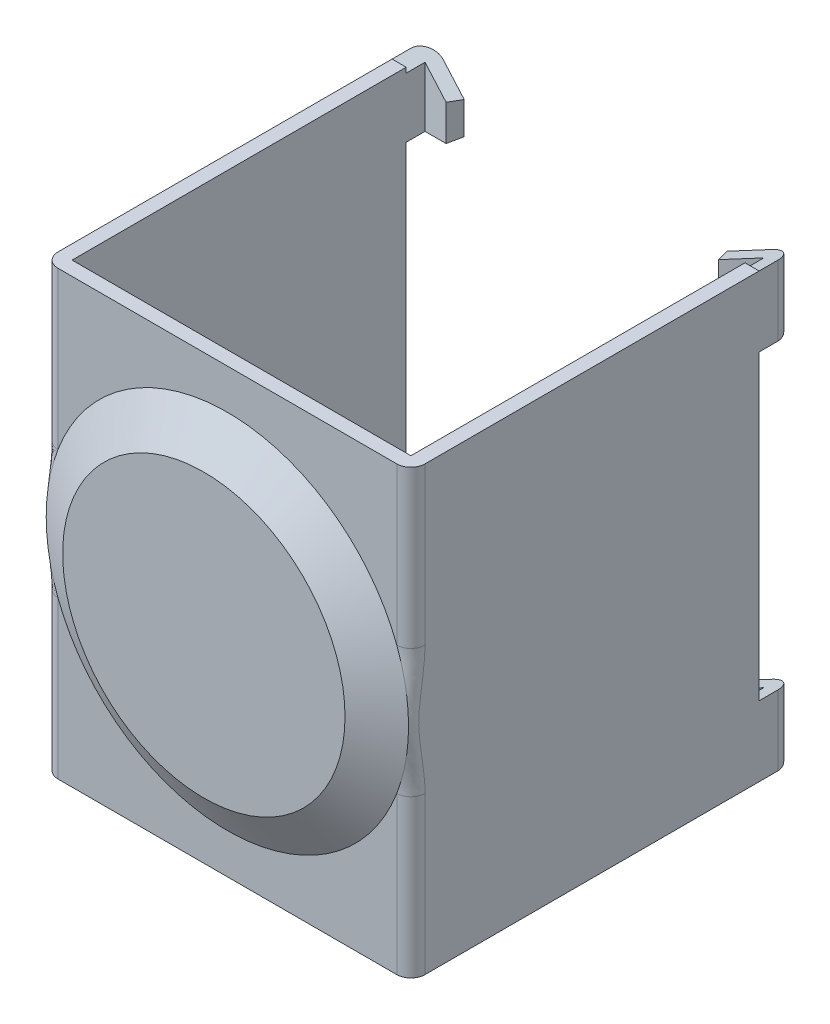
ISO-10303-21;
HEADER;
FILE_DESCRIPTION(('STEP AP214'),'2;1');
FILE_NAME('part.step','',(''),(''),'','','');
FILE_SCHEMA(('AUTOMOTIVE_DESIGN { 1 0 10303 214 1 1 1 1 }'));
ENDSEC;
DATA;
#1=APPLICATION_CONTEXT('core data for automotive mechanical design processes');
#2=APPLICATION_PROTOCOL_DEFINITION('international standard','automotive_design',2000,#1);
#3=PRODUCT_CONTEXT('',#1,'mechanical');
#4=PRODUCT('Part','Part','',(#3));
#5=PRODUCT_RELATED_PRODUCT_CATEGORY('part','',(#4));
#6=PRODUCT_DEFINITION_FORMATION('','',#4);
#7=PRODUCT_DEFINITION_CONTEXT('part definition',#1,'design');
#8=PRODUCT_DEFINITION('design','',#6,#7);
#9=PRODUCT_DEFINITION_SHAPE('','',#8);
#10=(LENGTH_UNIT() NAMED_UNIT(*) SI_UNIT(.MILLI.,.METRE.));
#11=(NAMED_UNIT(*) PLANE_ANGLE_UNIT() SI_UNIT($,.RADIAN.));
#12=(NAMED_UNIT(*) SI_UNIT($,.STERADIAN.) SOLID_ANGLE_UNIT());
#13=UNCERTAINTY_MEASURE_WITH_UNIT(LENGTH_MEASURE(1.E-05),#10,'distance_accuracy_value','');
#14=(GEOMETRIC_REPRESENTATION_CONTEXT(3) GLOBAL_UNCERTAINTY_ASSIGNED_CONTEXT((#13)) GLOBAL_UNIT_ASSIGNED_CONTEXT((#10,
#11,#12)) REPRESENTATION_CONTEXT('',''));
#15=CARTESIAN_POINT('',(0.,0.,0.));
#16=DIRECTION('',(0.,0.,1.));
#17=DIRECTION('',(1.,0.,0.));
#18=AXIS2_PLACEMENT_3D('',#15,#16,#17);
#19=CARTESIAN_POINT('',(67.2000000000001,304.4,5.69999999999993));
#20=DIRECTION('',(0.,0.,0.999999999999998));
#21=DIRECTION('',(0.,-1.,0.));
#22=AXIS2_PLACEMENT_3D('',#19,#20,#21);
#23=PLANE('',#22);
#24=DIRECTION('',(1.,0.,0.));
#25=VECTOR('',#24,1.);
#26=CARTESIAN_POINT('',(66.2174486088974,285.6,5.69999999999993));
#27=LINE('',#26,#25);
#28=CARTESIAN_POINT('',(52.8000000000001,285.6,5.69999999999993));
#29=VERTEX_POINT('',#28);
#30=CARTESIAN_POINT('',(67.2000000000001,285.6,5.69999999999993));
#31=VERTEX_POINT('',#30);
#32=EDGE_CURVE('E971',#29,#31,#27,.T.);
#33=ORIENTED_EDGE('',*,*,#32,.T.);
#34=DIRECTION('',(0.,1.,0.));
#35=VECTOR('',#34,1.);
#36=CARTESIAN_POINT('',(67.2000000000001,304.4,5.69999999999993));
#37=LINE('',#36,#35);
#38=CARTESIAN_POINT('',(67.2000000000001,292.270531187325,5.70000000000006));
#39=VERTEX_POINT('',#38);
#40=EDGE_CURVE('E818',#31,#39,#37,.T.);
#41=ORIENTED_EDGE('',*,*,#40,.T.);
#42=CARTESIAN_POINT('',(60.0000000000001,295.,5.70000000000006));
#43=DIRECTION('',(0.,0.,0.999999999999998));
#44=DIRECTION('',(1.,0.,0.));
#45=AXIS2_PLACEMENT_3D('',#42,#43,#44);
#46=CIRCLE('',#45,7.69999999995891);
#47=CARTESIAN_POINT('',(52.8000000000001,292.270531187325,5.70000000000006));
#48=VERTEX_POINT('',#47);
#49=EDGE_CURVE('E829',#48,#39,#46,.T.);
#50=ORIENTED_EDGE('',*,*,#49,.F.);
#51=DIRECTION('',(0.,-1.,0.));
#52=VECTOR('',#51,1.);
#53=CARTESIAN_POINT('',(52.8000000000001,304.4,5.69999999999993));
#54=LINE('',#53,#52);
#55=EDGE_CURVE('E700',#48,#29,#54,.T.);
#56=ORIENTED_EDGE('',*,*,#55,.T.);
#57=EDGE_LOOP('',(#33,#41,#50,#56));
#58=FACE_BOUND('',#57,.T.);
#59=ADVANCED_FACE('F44',(#58),#23,.T.);
#60=CARTESIAN_POINT('',(67.2000000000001,297.729468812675,5.70000000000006));
#61=VERTEX_POINT('',#60);
#62=CARTESIAN_POINT('',(52.8000000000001,297.729468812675,5.70000000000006));
#63=VERTEX_POINT('',#62);
#64=EDGE_CURVE('E811',#61,#63,#46,.T.);
#65=ORIENTED_EDGE('',*,*,#64,.F.);
#66=DIRECTION('',(0.,1.,0.));
#67=VECTOR('',#66,1.);
#68=CARTESIAN_POINT('',(67.2000000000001,304.4,5.69999999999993));
#69=LINE('',#68,#67);
#70=CARTESIAN_POINT('',(67.2000000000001,304.4,5.69999999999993));
#71=VERTEX_POINT('',#70);
#72=EDGE_CURVE('E756',#61,#71,#69,.T.);
#73=ORIENTED_EDGE('',*,*,#72,.T.);
#74=DIRECTION('',(1.,0.,0.));
#75=VECTOR('',#74,1.);
#76=CARTESIAN_POINT('',(66.2174486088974,304.4,5.69999999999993));
#77=LINE('',#76,#75);
#78=CARTESIAN_POINT('',(52.8000000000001,304.4,5.69999999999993));
#79=VERTEX_POINT('',#78);
#80=EDGE_CURVE('E833',#79,#71,#77,.T.);
#81=ORIENTED_EDGE('',*,*,#80,.F.);
#82=DIRECTION('',(0.,-1.,0.));
#83=VECTOR('',#82,1.);
#84=CARTESIAN_POINT('',(52.8000000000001,304.4,5.69999999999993));
#85=LINE('',#84,#83);
#86=EDGE_CURVE('E702',#79,#63,#85,.T.);
#87=ORIENTED_EDGE('',*,*,#86,.T.);
#88=EDGE_LOOP('',(#65,#73,#81,#87));
#89=FACE_BOUND('',#88,.T.);
#90=ADVANCED_FACE('F732',(#89),#23,.T.);
#91=CARTESIAN_POINT('',(54.4147510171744,304.4,-9.95078535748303));
#92=DIRECTION('',(0.342020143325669,0.,-0.939692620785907));
#93=DIRECTION('',(-0.939692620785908,0.,-0.342020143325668));
#94=AXIS2_PLACEMENT_3D('',#91,#92,#93);
#95=PLANE('',#94);
#96=DIRECTION('',(-0.889126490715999,-0.323615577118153,-0.323615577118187));
#97=VECTOR('',#96,1.);
#98=CARTESIAN_POINT('',(54.4147510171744,286.406103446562,-9.95078535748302));
#99=LINE('',#98,#97);
#100=CARTESIAN_POINT('',(54.4147510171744,286.406103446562,-9.95078535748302));
#101=VERTEX_POINT('',#100);
#102=CARTESIAN_POINT('',(53.0052120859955,285.893073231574,-10.4638155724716));
#103=VERTEX_POINT('',#102);
#104=EDGE_CURVE('E642',#101,#103,#99,.T.);
#105=ORIENTED_EDGE('',*,*,#104,.T.);
#106=DIRECTION('',(0.,-1.,0.));
#107=VECTOR('',#106,1.);
#108=CARTESIAN_POINT('',(53.0052120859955,304.4,-10.4638155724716));
#109=LINE('',#108,#107);
#110=CARTESIAN_POINT('',(53.0052120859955,288.288544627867,-10.4638155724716));
#111=VERTEX_POINT('',#110);
#112=EDGE_CURVE('E567',#111,#103,#109,.T.);
#113=ORIENTED_EDGE('',*,*,#112,.F.);
#114=DIRECTION('',(0.889126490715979,-0.323615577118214,0.32361557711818));
#115=VECTOR('',#114,1.);
#116=CARTESIAN_POINT('',(53.0052120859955,288.288544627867,-10.4638155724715));
#117=LINE('',#116,#115);
#118=CARTESIAN_POINT('',(54.4147510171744,287.775514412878,-9.95078535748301));
#119=VERTEX_POINT('',#118);
#120=EDGE_CURVE('E649',#111,#119,#117,.T.);
#121=ORIENTED_EDGE('',*,*,#120,.T.);
#122=DIRECTION('',(0.,1.,0.));
#123=VECTOR('',#122,1.);
#124=CARTESIAN_POINT('',(54.4147510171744,304.4,-9.95078535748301));
#125=LINE('',#124,#123);
#126=EDGE_CURVE('E590',#101,#119,#125,.T.);
#127=ORIENTED_EDGE('',*,*,#126,.F.);
#128=EDGE_LOOP('',(#105,#113,#121,#127));
#129=FACE_BOUND('',#128,.T.);
#130=ADVANCED_FACE('F1047',(#129),#95,.T.);
#131=CARTESIAN_POINT('',(54.4147510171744,304.4,-9.95078535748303));
#132=DIRECTION('',(0.342020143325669,0.,-0.939692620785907));
#133=DIRECTION('',(-0.939692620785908,0.,-0.342020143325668));
#134=AXIS2_PLACEMENT_3D('',#131,#132,#133);
#135=PLANE('',#134);
#136=DIRECTION('',(-0.889126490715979,-0.323615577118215,-0.32361557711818));
#137=VECTOR('',#136,1.);
#138=CARTESIAN_POINT('',(54.4147510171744,302.224485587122,-9.95078535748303));
#139=LINE('',#138,#137);
#140=CARTESIAN_POINT('',(54.4147510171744,302.224485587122,-9.95078535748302));
#141=VERTEX_POINT('',#140);
#142=CARTESIAN_POINT('',(53.0052120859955,301.711455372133,-10.4638155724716));
#143=VERTEX_POINT('',#142);
#144=EDGE_CURVE('E618',#141,#143,#139,.T.);
#145=ORIENTED_EDGE('',*,*,#144,.T.);
#146=DIRECTION('',(0.,-1.,0.));
#147=VECTOR('',#146,1.);
#148=CARTESIAN_POINT('',(53.0052120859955,304.4,-10.4638155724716));
#149=LINE('',#148,#147);
#150=CARTESIAN_POINT('',(53.0052120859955,304.106926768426,-10.4638155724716));
#151=VERTEX_POINT('',#150);
#152=EDGE_CURVE('E543',#151,#143,#149,.T.);
#153=ORIENTED_EDGE('',*,*,#152,.F.);
#154=DIRECTION('',(0.889126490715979,-0.323615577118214,0.32361557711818));
#155=VECTOR('',#154,1.);
#156=CARTESIAN_POINT('',(53.0052120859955,304.106926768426,-10.4638155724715));
#157=LINE('',#156,#155);
#158=CARTESIAN_POINT('',(54.4147510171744,303.593896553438,-9.95078535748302));
#159=VERTEX_POINT('',#158);
#160=EDGE_CURVE('E638',#151,#159,#157,.T.);
#161=ORIENTED_EDGE('',*,*,#160,.T.);
#162=DIRECTION('',(0.,1.,0.));
#163=VECTOR('',#162,1.);
#164=CARTESIAN_POINT('',(54.4147510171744,304.4,-9.95078535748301));
#165=LINE('',#164,#163);
#166=EDGE_CURVE('E617',#141,#159,#165,.T.);
#167=ORIENTED_EDGE('',*,*,#166,.F.);
#168=EDGE_LOOP('',(#145,#153,#161,#167));
#169=FACE_BOUND('',#168,.T.);
#170=ADVANCED_FACE('F1051',(#169),#135,.T.);
#171=CARTESIAN_POINT('',(54.209538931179,304.4,-9.3869697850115));
#172=DIRECTION('',(0.939692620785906,0.,0.342020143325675));
#173=DIRECTION('',(0.342020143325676,0.,-0.939692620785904));
#174=AXIS2_PLACEMENT_3D('',#171,#172,#173);
#175=PLANE('',#174);
#176=DIRECTION('',(0.339400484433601,0.12353167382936,-0.932495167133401));
#177=VECTOR('',#176,1.);
#178=CARTESIAN_POINT('',(54.209538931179,302.149794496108,-9.3869697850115));
#179=LINE('',#178,#177);
#180=CARTESIAN_POINT('',(54.209538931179,302.149794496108,-9.38696978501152));
#181=VERTEX_POINT('',#180);
#182=EDGE_CURVE('E621',#181,#141,#179,.T.);
#183=ORIENTED_EDGE('',*,*,#182,.T.);
#184=ORIENTED_EDGE('',*,*,#166,.T.);
#185=DIRECTION('',(-0.339400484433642,0.123531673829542,0.932495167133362));
#186=VECTOR('',#185,1.);
#187=CARTESIAN_POINT('',(54.4147510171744,303.593896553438,-9.95078535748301));
#188=LINE('',#187,#186);
#189=CARTESIAN_POINT('',(54.209538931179,303.668587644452,-9.38696978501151));
#190=VERTEX_POINT('',#189);
#191=EDGE_CURVE('E614',#159,#190,#188,.T.);
#192=ORIENTED_EDGE('',*,*,#191,.T.);
#193=DIRECTION('',(0.,1.,0.));
#194=VECTOR('',#193,1.);
#195=CARTESIAN_POINT('',(54.209538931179,304.4,-9.38696978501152));
#196=LINE('',#195,#194);
#197=EDGE_CURVE('E480',#181,#190,#196,.T.);
#198=ORIENTED_EDGE('',*,*,#197,.F.);
#199=EDGE_LOOP('',(#183,#184,#192,#198));
#200=FACE_BOUND('',#199,.T.);
#201=ADVANCED_FACE('F1056',(#200),#175,.T.);
#202=CARTESIAN_POINT('',(54.209538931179,304.4,-9.3869697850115));
#203=DIRECTION('',(0.939692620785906,0.,0.342020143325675));
#204=DIRECTION('',(0.342020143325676,0.,-0.939692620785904));
#205=AXIS2_PLACEMENT_3D('',#202,#203,#204);
#206=PLANE('',#205);
#207=DIRECTION('',(0.339400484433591,0.123531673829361,-0.932495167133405));
#208=VECTOR('',#207,1.);
#209=CARTESIAN_POINT('',(54.209538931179,286.331412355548,-9.3869697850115));
#210=LINE('',#209,#208);
#211=CARTESIAN_POINT('',(54.209538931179,286.331412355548,-9.3869697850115));
#212=VERTEX_POINT('',#211);
#213=EDGE_CURVE('E574',#212,#101,#210,.T.);
#214=ORIENTED_EDGE('',*,*,#213,.T.);
#215=ORIENTED_EDGE('',*,*,#126,.T.);
#216=DIRECTION('',(-0.33940048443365,0.123531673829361,0.932495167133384));
#217=VECTOR('',#216,1.);
#218=CARTESIAN_POINT('',(54.4147510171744,287.775514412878,-9.95078535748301));
#219=LINE('',#218,#217);
#220=CARTESIAN_POINT('',(54.209538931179,287.850205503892,-9.3869697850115));
#221=VERTEX_POINT('',#220);
#222=EDGE_CURVE('E630',#119,#221,#219,.T.);
#223=ORIENTED_EDGE('',*,*,#222,.T.);
#224=DIRECTION('',(0.,1.,0.));
#225=VECTOR('',#224,1.);
#226=CARTESIAN_POINT('',(54.209538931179,304.4,-9.38696978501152));
#227=LINE('',#226,#225);
#228=EDGE_CURVE('E461',#212,#221,#227,.T.);
#229=ORIENTED_EDGE('',*,*,#228,.F.);
#230=EDGE_LOOP('',(#214,#215,#223,#229));
#231=FACE_BOUND('',#230,.T.);
#232=ADVANCED_FACE('F1399',(#231),#206,.T.);
#233=CARTESIAN_POINT('',(65.7904610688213,304.4,-9.3869697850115));
#234=DIRECTION('',(-0.939692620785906,0.,0.342020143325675));
#235=DIRECTION('',(0.342020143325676,0.,0.939692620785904));
#236=AXIS2_PLACEMENT_3D('',#233,#234,#235);
#237=PLANE('',#236);
#238=DIRECTION('',(-0.339400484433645,-0.123531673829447,-0.932495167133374));
#239=VECTOR('',#238,1.);
#240=CARTESIAN_POINT('',(65.7904610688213,303.668587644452,-9.3869697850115));
#241=LINE('',#240,#239);
#242=CARTESIAN_POINT('',(65.7904610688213,303.668587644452,-9.38696978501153));
#243=VERTEX_POINT('',#242);
#244=CARTESIAN_POINT('',(65.5852489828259,303.593896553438,-9.95078535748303));
#245=VERTEX_POINT('',#244);
#246=EDGE_CURVE('E580',#243,#245,#241,.T.);
#247=ORIENTED_EDGE('',*,*,#246,.T.);
#248=DIRECTION('',(0.,1.,0.));
#249=VECTOR('',#248,1.);
#250=CARTESIAN_POINT('',(65.5852489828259,304.4,-9.95078535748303));
#251=LINE('',#250,#249);
#252=CARTESIAN_POINT('',(65.5852489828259,302.224485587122,-9.95078535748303));
#253=VERTEX_POINT('',#252);
#254=EDGE_CURVE('E411',#253,#245,#251,.T.);
#255=ORIENTED_EDGE('',*,*,#254,.F.);
#256=DIRECTION('',(0.339400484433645,-0.123531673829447,0.932495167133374));
#257=VECTOR('',#256,1.);
#258=CARTESIAN_POINT('',(65.5852489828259,302.224485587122,-9.95078535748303));
#259=LINE('',#258,#257);
#260=CARTESIAN_POINT('',(65.7904610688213,302.149794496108,-9.38696978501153));
#261=VERTEX_POINT('',#260);
#262=EDGE_CURVE('E586',#253,#261,#259,.T.);
#263=ORIENTED_EDGE('',*,*,#262,.T.);
#264=DIRECTION('',(0.,1.,0.));
#265=VECTOR('',#264,1.);
#266=CARTESIAN_POINT('',(65.7904610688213,304.4,-9.38696978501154));
#267=LINE('',#266,#265);
#268=EDGE_CURVE('E532',#243,#261,#267,.F.);
#269=ORIENTED_EDGE('',*,*,#268,.F.);
#270=EDGE_LOOP('',(#247,#255,#263,#269));
#271=FACE_BOUND('',#270,.T.);
#272=ADVANCED_FACE('F1388',(#271),#237,.T.);
#273=CARTESIAN_POINT('',(52.8000000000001,304.4,-9.90000000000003));
#274=DIRECTION('',(0.,-1.,0.));
#275=DIRECTION('',(0.,0.,-0.999999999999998));
#276=AXIS2_PLACEMENT_3D('',#273,#274,#275);
#277=CYLINDRICAL_SURFACE('',#276,0.599999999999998);
#278=CARTESIAN_POINT('',(52.8000000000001,285.81838214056,-9.90000000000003));
#279=DIRECTION('',(-0.342020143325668,0.939692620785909,0.));
#280=DIRECTION('',(-0.939692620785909,-0.342020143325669,0.));
#281=AXIS2_PLACEMENT_3D('',#278,#279,#280);
#282=ELLIPSE('',#281,0.638506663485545,0.599999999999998);
#283=CARTESIAN_POINT('',(52.2000000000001,285.6,-9.90000000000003));
#284=VERTEX_POINT('',#283);
#285=EDGE_CURVE('E469',#103,#284,#282,.T.);
#286=ORIENTED_EDGE('',*,*,#285,.T.);
#287=DIRECTION('',(0.,1.,0.));
#288=VECTOR('',#287,1.);
#289=CARTESIAN_POINT('',(52.2000000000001,304.4,-9.90000000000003));
#290=LINE('',#289,#288);
#291=CARTESIAN_POINT('',(52.2000000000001,288.58161785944,-9.90000000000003));
#292=VERTEX_POINT('',#291);
#293=EDGE_CURVE('E568',#292,#284,#290,.F.);
#294=ORIENTED_EDGE('',*,*,#293,.F.);
#295=CARTESIAN_POINT('',(52.8000000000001,288.363235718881,-9.90000000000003));
#296=DIRECTION('',(-0.342020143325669,-0.939692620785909,0.));
#297=DIRECTION('',(0.939692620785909,-0.342020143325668,0.));
#298=AXIS2_PLACEMENT_3D('',#295,#296,#297);
#299=ELLIPSE('',#298,0.638506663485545,0.599999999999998);
#300=EDGE_CURVE('E460',#292,#111,#299,.T.);
#301=ORIENTED_EDGE('',*,*,#300,.T.);
#302=ORIENTED_EDGE('',*,*,#112,.T.);
#303=EDGE_LOOP('',(#286,#294,#301,#302));
#304=FACE_BOUND('',#303,.T.);
#305=ADVANCED_FACE('F1377',(#304),#277,.T.);
#306=CARTESIAN_POINT('',(52.8000000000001,304.4,-9.90000000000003));
#307=DIRECTION('',(0.,-1.,0.));
#308=DIRECTION('',(0.,0.,-0.999999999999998));
#309=AXIS2_PLACEMENT_3D('',#306,#307,#308);
#310=CYLINDRICAL_SURFACE('',#309,0.599999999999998);
#311=CARTESIAN_POINT('',(52.8000000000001,301.636764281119,-9.90000000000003));
#312=DIRECTION('',(-0.342020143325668,0.939692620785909,0.));
#313=DIRECTION('',(-0.939692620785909,-0.342020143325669,0.));
#314=AXIS2_PLACEMENT_3D('',#311,#312,#313);
#315=ELLIPSE('',#314,0.638506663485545,0.599999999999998);
#316=CARTESIAN_POINT('',(52.2000000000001,301.41838214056,-9.90000000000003));
#317=VERTEX_POINT('',#316);
#318=EDGE_CURVE('E504',#143,#317,#315,.T.);
#319=ORIENTED_EDGE('',*,*,#318,.T.);
#320=DIRECTION('',(0.,1.,0.));
#321=VECTOR('',#320,1.);
#322=CARTESIAN_POINT('',(52.2000000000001,304.4,-9.90000000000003));
#323=LINE('',#322,#321);
#324=CARTESIAN_POINT('',(52.2000000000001,304.4,-9.90000000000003));
#325=VERTEX_POINT('',#324);
#326=EDGE_CURVE('E370',#325,#317,#323,.F.);
#327=ORIENTED_EDGE('',*,*,#326,.F.);
#328=CARTESIAN_POINT('',(52.8000000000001,304.18161785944,-9.90000000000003));
#329=DIRECTION('',(-0.342020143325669,-0.939692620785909,0.));
#330=DIRECTION('',(0.939692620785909,-0.342020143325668,0.));
#331=AXIS2_PLACEMENT_3D('',#328,#329,#330);
#332=ELLIPSE('',#331,0.638506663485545,0.599999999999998);
#333=EDGE_CURVE('E479',#325,#151,#332,.T.);
#334=ORIENTED_EDGE('',*,*,#333,.T.);
#335=ORIENTED_EDGE('',*,*,#152,.T.);
#336=EDGE_LOOP('',(#319,#327,#334,#335));
#337=FACE_BOUND('',#336,.T.);
#338=ADVANCED_FACE('F1366',(#337),#310,.T.);
#339=CARTESIAN_POINT('',(67.2000000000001,304.4,-9.90000000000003));
#340=DIRECTION('',(0.34202014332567,0.,0.939692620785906));
#341=DIRECTION('',(0.939692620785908,0.,-0.342020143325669));
#342=AXIS2_PLACEMENT_3D('',#339,#340,#341);
#343=PLANE('',#342);
#344=DIRECTION('',(-0.889126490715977,-0.323615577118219,0.323615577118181));
#345=VECTOR('',#344,1.);
#346=CARTESIAN_POINT('',(67.2000000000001,288.363235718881,-9.90000000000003));
#347=LINE('',#346,#345);
#348=CARTESIAN_POINT('',(67.2000000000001,288.363235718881,-9.90000000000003));
#349=VERTEX_POINT('',#348);
#350=CARTESIAN_POINT('',(65.7904610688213,287.850205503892,-9.38696978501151));
#351=VERTEX_POINT('',#350);
#352=EDGE_CURVE('E526',#349,#351,#347,.T.);
#353=ORIENTED_EDGE('',*,*,#352,.T.);
#354=DIRECTION('',(0.,1.,0.));
#355=VECTOR('',#354,1.);
#356=CARTESIAN_POINT('',(65.7904610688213,304.4,-9.3869697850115));
#357=LINE('',#356,#355);
#358=CARTESIAN_POINT('',(65.7904610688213,286.331412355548,-9.38696978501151));
#359=VERTEX_POINT('',#358);
#360=EDGE_CURVE('E445',#359,#351,#357,.T.);
#361=ORIENTED_EDGE('',*,*,#360,.F.);
#362=DIRECTION('',(0.889126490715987,-0.323615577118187,-0.323615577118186));
#363=VECTOR('',#362,1.);
#364=CARTESIAN_POINT('',(65.7904610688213,286.331412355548,-9.38696978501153));
#365=LINE('',#364,#363);
#366=CARTESIAN_POINT('',(67.2000000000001,285.81838214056,-9.90000000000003));
#367=VERTEX_POINT('',#366);
#368=EDGE_CURVE('E540',#359,#367,#365,.T.);
#369=ORIENTED_EDGE('',*,*,#368,.T.);
#370=DIRECTION('',(0.,1.,0.));
#371=VECTOR('',#370,1.);
#372=CARTESIAN_POINT('',(67.2000000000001,304.4,-9.90000000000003));
#373=LINE('',#372,#371);
#374=EDGE_CURVE('E437',#349,#367,#373,.F.);
#375=ORIENTED_EDGE('',*,*,#374,.F.);
#376=EDGE_LOOP('',(#353,#361,#369,#375));
#377=FACE_BOUND('',#376,.T.);
#378=ADVANCED_FACE('F1355',(#377),#343,.T.);
#379=CARTESIAN_POINT('',(67.2000000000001,304.4,-9.90000000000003));
#380=DIRECTION('',(0.34202014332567,0.,0.939692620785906));
#381=DIRECTION('',(0.939692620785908,0.,-0.342020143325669));
#382=AXIS2_PLACEMENT_3D('',#379,#380,#381);
#383=PLANE('',#382);
#384=DIRECTION('',(-0.889126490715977,-0.323615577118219,0.323615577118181));
#385=VECTOR('',#384,1.);
#386=CARTESIAN_POINT('',(67.2000000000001,304.18161785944,-9.90000000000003));
#387=LINE('',#386,#385);
#388=CARTESIAN_POINT('',(67.2000000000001,304.18161785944,-9.90000000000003));
#389=VERTEX_POINT('',#388);
#390=EDGE_CURVE('E525',#389,#243,#387,.T.);
#391=ORIENTED_EDGE('',*,*,#390,.T.);
#392=ORIENTED_EDGE('',*,*,#268,.T.);
#393=DIRECTION('',(0.889126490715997,-0.323615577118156,-0.323615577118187));
#394=VECTOR('',#393,1.);
#395=CARTESIAN_POINT('',(65.7904610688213,302.149794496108,-9.38696978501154));
#396=LINE('',#395,#394);
#397=CARTESIAN_POINT('',(67.2000000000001,301.636764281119,-9.90000000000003));
#398=VERTEX_POINT('',#397);
#399=EDGE_CURVE('E522',#261,#398,#396,.T.);
#400=ORIENTED_EDGE('',*,*,#399,.T.);
#401=DIRECTION('',(0.,1.,0.));
#402=VECTOR('',#401,1.);
#403=CARTESIAN_POINT('',(67.2000000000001,304.4,-9.90000000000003));
#404=LINE('',#403,#402);
#405=EDGE_CURVE('E362',#389,#398,#404,.F.);
#406=ORIENTED_EDGE('',*,*,#405,.F.);
#407=EDGE_LOOP('',(#391,#392,#400,#406));
#408=FACE_BOUND('',#407,.T.);
#409=ADVANCED_FACE('F1345',(#408),#383,.T.);
#410=CARTESIAN_POINT('',(54.2185292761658,301.46135116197,-9.10000000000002));
#411=DIRECTION('',(0.,0.,0.999999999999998));
#412=DIRECTION('',(0.,-1.,0.));
#413=AXIS2_PLACEMENT_3D('',#410,#411,#412);
#414=PLANE('',#413);
#415=DIRECTION('',(-0.939692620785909,-0.342020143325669,0.));
#416=VECTOR('',#415,1.);
#417=CARTESIAN_POINT('',(51.6000000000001,301.2,-9.10000000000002));
#418=LINE('',#417,#416);
#419=CARTESIAN_POINT('',(52.2000000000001,301.41838214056,-9.10000000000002));
#420=VERTEX_POINT('',#419);
#421=CARTESIAN_POINT('',(52.8000000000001,301.636764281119,-9.10000000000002));
#422=VERTEX_POINT('',#421);
#423=EDGE_CURVE('E493',#420,#422,#418,.F.);
#424=ORIENTED_EDGE('',*,*,#423,.T.);
#425=DIRECTION('',(0.,1.,0.));
#426=VECTOR('',#425,1.);
#427=CARTESIAN_POINT('',(52.8000000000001,304.4,-9.10000000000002));
#428=LINE('',#427,#426);
#429=CARTESIAN_POINT('',(52.8000000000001,288.363235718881,-9.10000000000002));
#430=VERTEX_POINT('',#429);
#431=EDGE_CURVE('E499',#430,#422,#428,.T.);
#432=ORIENTED_EDGE('',*,*,#431,.F.);
#433=DIRECTION('',(0.939692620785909,-0.342020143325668,0.));
#434=VECTOR('',#433,1.);
#435=CARTESIAN_POINT('',(51.6000000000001,288.8,-9.10000000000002));
#436=LINE('',#435,#434);
#437=CARTESIAN_POINT('',(52.2000000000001,288.58161785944,-9.10000000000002));
#438=VERTEX_POINT('',#437);
#439=EDGE_CURVE('E446',#430,#438,#436,.F.);
#440=ORIENTED_EDGE('',*,*,#439,.T.);
#441=DIRECTION('',(0.,1.,0.));
#442=VECTOR('',#441,1.);
#443=CARTESIAN_POINT('',(52.2000000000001,304.4,-9.10000000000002));
#444=LINE('',#443,#442);
#445=EDGE_CURVE('E385',#420,#438,#444,.F.);
#446=ORIENTED_EDGE('',*,*,#445,.F.);
#447=EDGE_LOOP('',(#424,#432,#440,#446));
#448=FACE_BOUND('',#447,.T.);
#449=ADVANCED_FACE('F936',(#448),#414,.F.);
#450=CARTESIAN_POINT('',(51.6000000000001,301.2,-9.10000000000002));
#451=DIRECTION('',(-0.342020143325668,0.939692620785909,0.));
#452=DIRECTION('',(-0.939692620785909,-0.342020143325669,0.));
#453=AXIS2_PLACEMENT_3D('',#450,#451,#452);
#454=PLANE('',#453);
#455=ORIENTED_EDGE('',*,*,#423,.F.);
#456=DIRECTION('',(0.,0.,0.999999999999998));
#457=VECTOR('',#456,1.);
#458=CARTESIAN_POINT('',(52.2000000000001,301.41838214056,-9.90000000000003));
#459=LINE('',#458,#457);
#460=EDGE_CURVE('E438',#317,#420,#459,.T.);
#461=ORIENTED_EDGE('',*,*,#460,.F.);
#462=ORIENTED_EDGE('',*,*,#318,.F.);
#463=ORIENTED_EDGE('',*,*,#144,.F.);
#464=ORIENTED_EDGE('',*,*,#182,.F.);
#465=DIRECTION('',(0.889126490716,0.323615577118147,0.32361557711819));
#466=VECTOR('',#465,1.);
#467=CARTESIAN_POINT('',(52.8000000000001,301.636764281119,-9.90000000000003));
#468=LINE('',#467,#466);
#469=CARTESIAN_POINT('',(52.8000000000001,301.636764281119,-9.90000000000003));
#470=VERTEX_POINT('',#469);
#471=EDGE_CURVE('E489',#470,#181,#468,.T.);
#472=ORIENTED_EDGE('',*,*,#471,.F.);
#473=DIRECTION('',(0.,0.,0.999999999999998));
#474=VECTOR('',#473,1.);
#475=CARTESIAN_POINT('',(52.8000000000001,301.636764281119,5.09999999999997));
#476=LINE('',#475,#474);
#477=EDGE_CURVE('E486',#422,#470,#476,.F.);
#478=ORIENTED_EDGE('',*,*,#477,.F.);
#479=EDGE_LOOP('',(#455,#461,#462,#463,#464,#472,#478));
#480=FACE_BOUND('',#479,.T.);
#481=ADVANCED_FACE('F941',(#480),#454,.F.);
#482=CARTESIAN_POINT('',(52.8000000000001,304.4,-9.90000000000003));
#483=DIRECTION('',(-0.34202014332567,0.,0.939692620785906));
#484=DIRECTION('',(0.939692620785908,0.,0.342020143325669));
#485=AXIS2_PLACEMENT_3D('',#482,#483,#484);
#486=PLANE('',#485);
#487=ORIENTED_EDGE('',*,*,#471,.T.);
#488=ORIENTED_EDGE('',*,*,#197,.T.);
#489=DIRECTION('',(-0.889126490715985,0.323615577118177,-0.323615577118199));
#490=VECTOR('',#489,1.);
#491=CARTESIAN_POINT('',(54.209538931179,303.668587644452,-9.3869697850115));
#492=LINE('',#491,#490);
#493=CARTESIAN_POINT('',(52.8000000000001,304.18161785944,-9.90000000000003));
#494=VERTEX_POINT('',#493);
#495=EDGE_CURVE('E476',#190,#494,#492,.T.);
#496=ORIENTED_EDGE('',*,*,#495,.T.);
#497=DIRECTION('',(0.,1.,0.));
#498=VECTOR('',#497,1.);
#499=CARTESIAN_POINT('',(52.8000000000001,304.4,-9.90000000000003));
#500=LINE('',#499,#498);
#501=EDGE_CURVE('E473',#470,#494,#500,.T.);
#502=ORIENTED_EDGE('',*,*,#501,.F.);
#503=EDGE_LOOP('',(#487,#488,#496,#502));
#504=FACE_BOUND('',#503,.T.);
#505=ADVANCED_FACE('F945',(#504),#486,.T.);
#506=CARTESIAN_POINT('',(56.9924323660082,302.655697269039,-9.10000000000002));
#507=DIRECTION('',(-0.342020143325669,-0.939692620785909,0.));
#508=DIRECTION('',(0.939692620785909,-0.342020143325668,0.));
#509=AXIS2_PLACEMENT_3D('',#506,#507,#508);
#510=PLANE('',#509);
#511=DIRECTION('',(0.,0.,0.999999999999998));
#512=VECTOR('',#511,1.);
#513=CARTESIAN_POINT('',(52.2000000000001,304.4,-9.90000000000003));
#514=LINE('',#513,#512);
#515=CARTESIAN_POINT('',(52.2000000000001,304.4,-9.10000000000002));
#516=VERTEX_POINT('',#515);
#517=EDGE_CURVE('E366',#516,#325,#514,.F.);
#518=ORIENTED_EDGE('',*,*,#517,.F.);
#519=DIRECTION('',(0.939692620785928,-0.342020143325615,0.));
#520=VECTOR('',#519,1.);
#521=CARTESIAN_POINT('',(52.2000000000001,304.4,-9.10000000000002));
#522=LINE('',#521,#520);
#523=CARTESIAN_POINT('',(52.8000000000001,304.18161785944,-9.10000000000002));
#524=VERTEX_POINT('',#523);
#525=EDGE_CURVE('E382',#516,#524,#522,.T.);
#526=ORIENTED_EDGE('',*,*,#525,.T.);
#527=DIRECTION('',(0.,0.,0.999999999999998));
#528=VECTOR('',#527,1.);
#529=CARTESIAN_POINT('',(52.8000000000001,304.18161785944,5.09999999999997));
#530=LINE('',#529,#528);
#531=EDGE_CURVE('E393',#494,#524,#530,.T.);
#532=ORIENTED_EDGE('',*,*,#531,.F.);
#533=ORIENTED_EDGE('',*,*,#495,.F.);
#534=ORIENTED_EDGE('',*,*,#191,.F.);
#535=ORIENTED_EDGE('',*,*,#160,.F.);
#536=ORIENTED_EDGE('',*,*,#333,.F.);
#537=EDGE_LOOP('',(#518,#526,#532,#533,#534,#535,#536));
#538=FACE_BOUND('',#537,.T.);
#539=ADVANCED_FACE('F949',(#538),#510,.F.);
#540=CARTESIAN_POINT('',(56.9924323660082,287.344302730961,-9.10000000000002));
#541=DIRECTION('',(-0.342020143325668,0.939692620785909,0.));
#542=DIRECTION('',(-0.939692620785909,-0.342020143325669,0.));
#543=AXIS2_PLACEMENT_3D('',#540,#541,#542);
#544=PLANE('',#543);
#545=ORIENTED_EDGE('',*,*,#104,.F.);
#546=ORIENTED_EDGE('',*,*,#213,.F.);
#547=DIRECTION('',(0.88912649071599,0.323615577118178,0.323615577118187));
#548=VECTOR('',#547,1.);
#549=CARTESIAN_POINT('',(52.8000000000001,285.81838214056,-9.90000000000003));
#550=LINE('',#549,#548);
#551=CARTESIAN_POINT('',(52.8000000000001,285.81838214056,-9.90000000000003));
#552=VERTEX_POINT('',#551);
#553=EDGE_CURVE('E465',#552,#212,#550,.T.);
#554=ORIENTED_EDGE('',*,*,#553,.F.);
#555=DIRECTION('',(0.,0.,0.999999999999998));
#556=VECTOR('',#555,1.);
#557=CARTESIAN_POINT('',(52.8000000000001,285.81838214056,5.09999999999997));
#558=LINE('',#557,#556);
#559=CARTESIAN_POINT('',(52.8000000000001,285.81838214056,-9.10000000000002));
#560=VERTEX_POINT('',#559);
#561=EDGE_CURVE('E602',#560,#552,#558,.F.);
#562=ORIENTED_EDGE('',*,*,#561,.F.);
#563=DIRECTION('',(-0.939692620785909,-0.342020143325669,0.));
#564=VECTOR('',#563,1.);
#565=CARTESIAN_POINT('',(56.9924323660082,287.344302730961,-9.10000000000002));
#566=LINE('',#565,#564);
#567=CARTESIAN_POINT('',(52.2000000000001,285.6,-9.10000000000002));
#568=VERTEX_POINT('',#567);
#569=EDGE_CURVE('E325',#568,#560,#566,.F.);
#570=ORIENTED_EDGE('',*,*,#569,.F.);
#571=DIRECTION('',(0.,0.,0.999999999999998));
#572=VECTOR('',#571,1.);
#573=CARTESIAN_POINT('',(52.2000000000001,285.6,-9.90000000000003));
#574=LINE('',#573,#572);
#575=EDGE_CURVE('E371',#284,#568,#574,.T.);
#576=ORIENTED_EDGE('',*,*,#575,.F.);
#577=ORIENTED_EDGE('',*,*,#285,.F.);
#578=EDGE_LOOP('',(#545,#546,#554,#562,#570,#576,#577));
#579=FACE_BOUND('',#578,.T.);
#580=ADVANCED_FACE('F924',(#579),#544,.F.);
#581=CARTESIAN_POINT('',(52.8000000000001,304.4,-9.90000000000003));
#582=DIRECTION('',(-0.34202014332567,0.,0.939692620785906));
#583=DIRECTION('',(0.939692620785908,0.,0.342020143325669));
#584=AXIS2_PLACEMENT_3D('',#581,#582,#583);
#585=PLANE('',#584);
#586=ORIENTED_EDGE('',*,*,#553,.T.);
#587=ORIENTED_EDGE('',*,*,#228,.T.);
#588=DIRECTION('',(-0.889126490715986,0.323615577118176,-0.323615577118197));
#589=VECTOR('',#588,1.);
#590=CARTESIAN_POINT('',(54.209538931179,287.850205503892,-9.3869697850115));
#591=LINE('',#590,#589);
#592=CARTESIAN_POINT('',(52.8000000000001,288.363235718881,-9.90000000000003));
#593=VERTEX_POINT('',#592);
#594=EDGE_CURVE('E457',#221,#593,#591,.T.);
#595=ORIENTED_EDGE('',*,*,#594,.T.);
#596=DIRECTION('',(0.,1.,0.));
#597=VECTOR('',#596,1.);
#598=CARTESIAN_POINT('',(52.8000000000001,304.4,-9.90000000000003));
#599=LINE('',#598,#597);
#600=EDGE_CURVE('E519',#552,#593,#599,.T.);
#601=ORIENTED_EDGE('',*,*,#600,.F.);
#602=EDGE_LOOP('',(#586,#587,#595,#601));
#603=FACE_BOUND('',#602,.T.);
#604=ADVANCED_FACE('F928',(#603),#585,.T.);
#605=CARTESIAN_POINT('',(51.6000000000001,288.8,-9.10000000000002));
#606=DIRECTION('',(-0.342020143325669,-0.939692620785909,0.));
#607=DIRECTION('',(0.939692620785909,-0.342020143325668,0.));
#608=AXIS2_PLACEMENT_3D('',#605,#606,#607);
#609=PLANE('',#608);
#610=ORIENTED_EDGE('',*,*,#439,.F.);
#611=DIRECTION('',(0.,0.,0.999999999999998));
#612=VECTOR('',#611,1.);
#613=CARTESIAN_POINT('',(52.8000000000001,288.363235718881,5.09999999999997));
#614=LINE('',#613,#612);
#615=EDGE_CURVE('E329',#593,#430,#614,.T.);
#616=ORIENTED_EDGE('',*,*,#615,.F.);
#617=ORIENTED_EDGE('',*,*,#594,.F.);
#618=ORIENTED_EDGE('',*,*,#222,.F.);
#619=ORIENTED_EDGE('',*,*,#120,.F.);
#620=ORIENTED_EDGE('',*,*,#300,.F.);
#621=DIRECTION('',(0.,0.,0.999999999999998));
#622=VECTOR('',#621,1.);
#623=CARTESIAN_POINT('',(52.2000000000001,288.58161785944,-9.90000000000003));
#624=LINE('',#623,#622);
#625=EDGE_CURVE('E561',#438,#292,#624,.F.);
#626=ORIENTED_EDGE('',*,*,#625,.F.);
#627=EDGE_LOOP('',(#610,#616,#617,#618,#619,#620,#626));
#628=FACE_BOUND('',#627,.T.);
#629=ADVANCED_FACE('F933',(#628),#609,.F.);
#630=CARTESIAN_POINT('',(65.7904610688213,304.4,-9.3869697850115));
#631=DIRECTION('',(-0.939692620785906,0.,0.342020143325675));
#632=DIRECTION('',(0.342020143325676,0.,0.939692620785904));
#633=AXIS2_PLACEMENT_3D('',#630,#631,#632);
#634=PLANE('',#633);
#635=DIRECTION('',(-0.339400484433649,-0.123531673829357,-0.932495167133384));
#636=VECTOR('',#635,1.);
#637=CARTESIAN_POINT('',(65.7904610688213,287.850205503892,-9.3869697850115));
#638=LINE('',#637,#636);
#639=CARTESIAN_POINT('',(65.5852489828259,287.775514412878,-9.95078535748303));
#640=VERTEX_POINT('',#639);
#641=EDGE_CURVE('E430',#351,#640,#638,.T.);
#642=ORIENTED_EDGE('',*,*,#641,.T.);
#643=DIRECTION('',(0.,1.,0.));
#644=VECTOR('',#643,1.);
#645=CARTESIAN_POINT('',(65.5852489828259,304.4,-9.95078535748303));
#646=LINE('',#645,#644);
#647=CARTESIAN_POINT('',(65.5852489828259,286.406103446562,-9.95078535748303));
#648=VERTEX_POINT('',#647);
#649=EDGE_CURVE('E894',#648,#640,#646,.T.);
#650=ORIENTED_EDGE('',*,*,#649,.F.);
#651=DIRECTION('',(0.339400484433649,-0.123531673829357,0.932495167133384));
#652=VECTOR('',#651,1.);
#653=CARTESIAN_POINT('',(65.5852489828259,286.406103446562,-9.95078535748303));
#654=LINE('',#653,#652);
#655=EDGE_CURVE('E441',#648,#359,#654,.T.);
#656=ORIENTED_EDGE('',*,*,#655,.T.);
#657=ORIENTED_EDGE('',*,*,#360,.T.);
#658=EDGE_LOOP('',(#642,#650,#656,#657));
#659=FACE_BOUND('',#658,.T.);
#660=ADVANCED_FACE('F1270',(#659),#634,.T.);
#661=CARTESIAN_POINT('',(65.5852489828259,304.4,-9.95078535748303));
#662=DIRECTION('',(-0.342020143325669,0.,-0.939692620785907));
#663=DIRECTION('',(-0.939692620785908,0.,0.342020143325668));
#664=AXIS2_PLACEMENT_3D('',#661,#662,#663);
#665=PLANE('',#664);
#666=DIRECTION('',(0.889126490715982,0.323615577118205,-0.323615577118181));
#667=VECTOR('',#666,1.);
#668=CARTESIAN_POINT('',(65.5852489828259,303.593896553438,-9.95078535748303));
#669=LINE('',#668,#667);
#670=CARTESIAN_POINT('',(66.9947879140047,304.106926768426,-10.4638155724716));
#671=VERTEX_POINT('',#670);
#672=EDGE_CURVE('E386',#245,#671,#669,.T.);
#673=ORIENTED_EDGE('',*,*,#672,.T.);
#674=DIRECTION('',(0.,1.,0.));
#675=VECTOR('',#674,1.);
#676=CARTESIAN_POINT('',(66.9947879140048,304.4,-10.4638155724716));
#677=LINE('',#676,#675);
#678=CARTESIAN_POINT('',(66.9947879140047,301.711455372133,-10.4638155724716));
#679=VERTEX_POINT('',#678);
#680=EDGE_CURVE('E689',#679,#671,#677,.T.);
#681=ORIENTED_EDGE('',*,*,#680,.F.);
#682=DIRECTION('',(-0.889126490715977,0.323615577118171,0.323615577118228));
#683=VECTOR('',#682,1.);
#684=CARTESIAN_POINT('',(66.9947879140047,301.711455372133,-10.4638155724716));
#685=LINE('',#684,#683);
#686=EDGE_CURVE('E418',#679,#253,#685,.T.);
#687=ORIENTED_EDGE('',*,*,#686,.T.);
#688=ORIENTED_EDGE('',*,*,#254,.T.);
#689=EDGE_LOOP('',(#673,#681,#687,#688));
#690=FACE_BOUND('',#689,.T.);
#691=ADVANCED_FACE('F1260',(#690),#665,.T.);
#692=CARTESIAN_POINT('',(54.2185292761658,301.46135116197,-9.10000000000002));
#693=DIRECTION('',(0.,0.,0.999999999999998));
#694=DIRECTION('',(0.,-1.,0.));
#695=AXIS2_PLACEMENT_3D('',#692,#693,#694);
#696=PLANE('',#695);
#697=DIRECTION('',(0.,1.,0.));
#698=VECTOR('',#697,1.);
#699=CARTESIAN_POINT('',(52.8000000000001,304.4,-9.10000000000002));
#700=LINE('',#699,#698);
#701=CARTESIAN_POINT('',(52.8000000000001,304.4,-9.10000000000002));
#702=VERTEX_POINT('',#701);
#703=EDGE_CURVE('E389',#524,#702,#700,.T.);
#704=ORIENTED_EDGE('',*,*,#703,.F.);
#705=ORIENTED_EDGE('',*,*,#525,.F.);
#706=DIRECTION('',(1.,0.,0.));
#707=VECTOR('',#706,1.);
#708=CARTESIAN_POINT('',(66.2174486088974,304.4,-9.10000000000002));
#709=LINE('',#708,#707);
#710=EDGE_CURVE('E374',#702,#516,#709,.F.);
#711=ORIENTED_EDGE('',*,*,#710,.F.);
#712=EDGE_LOOP('',(#704,#705,#711));
#713=FACE_BOUND('',#712,.T.);
#714=ADVANCED_FACE('F1250',(#713),#696,.F.);
#715=CARTESIAN_POINT('',(65.1814707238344,304.13864883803,-9.10000000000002));
#716=DIRECTION('',(0.,0.,0.999999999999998));
#717=DIRECTION('',(0.,-1.,0.));
#718=AXIS2_PLACEMENT_3D('',#715,#716,#717);
#719=PLANE('',#718);
#720=DIRECTION('',(0.939692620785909,0.342020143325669,0.));
#721=VECTOR('',#720,1.);
#722=CARTESIAN_POINT('',(63.007567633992,302.655697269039,-9.10000000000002));
#723=LINE('',#722,#721);
#724=CARTESIAN_POINT('',(67.8000000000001,304.4,-9.10000000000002));
#725=VERTEX_POINT('',#724);
#726=CARTESIAN_POINT('',(67.2000000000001,304.18161785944,-9.10000000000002));
#727=VERTEX_POINT('',#726);
#728=EDGE_CURVE('E406',#725,#727,#723,.F.);
#729=ORIENTED_EDGE('',*,*,#728,.T.);
#730=DIRECTION('',(0.,1.,0.));
#731=VECTOR('',#730,1.);
#732=CARTESIAN_POINT('',(67.2000000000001,304.4,-9.10000000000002));
#733=LINE('',#732,#731);
#734=CARTESIAN_POINT('',(67.2000000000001,304.4,-9.10000000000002));
#735=VERTEX_POINT('',#734);
#736=EDGE_CURVE('E358',#735,#727,#733,.F.);
#737=ORIENTED_EDGE('',*,*,#736,.F.);
#738=DIRECTION('',(1.,0.,0.));
#739=VECTOR('',#738,1.);
#740=CARTESIAN_POINT('',(66.2174486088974,304.4,-9.10000000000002));
#741=LINE('',#740,#739);
#742=EDGE_CURVE('E355',#725,#735,#741,.F.);
#743=ORIENTED_EDGE('',*,*,#742,.F.);
#744=EDGE_LOOP('',(#729,#737,#743));
#745=FACE_BOUND('',#744,.T.);
#746=ADVANCED_FACE('F729',(#745),#719,.F.);
#747=CARTESIAN_POINT('',(52.2000000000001,304.4,-9.90000000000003));
#748=DIRECTION('',(-1.,0.,0.));
#749=DIRECTION('',(0.,0.,0.999999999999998));
#750=AXIS2_PLACEMENT_3D('',#747,#748,#749);
#751=PLANE('',#750);
#752=DIRECTION('',(0.,0.,0.999999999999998));
#753=VECTOR('',#752,1.);
#754=CARTESIAN_POINT('',(52.2000000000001,285.6,-0.65667858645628));
#755=LINE('',#754,#753);
#756=CARTESIAN_POINT('',(52.2000000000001,285.6,5.09999999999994));
#757=VERTEX_POINT('',#756);
#758=EDGE_CURVE('E334',#568,#757,#755,.T.);
#759=ORIENTED_EDGE('',*,*,#758,.T.);
#760=DIRECTION('',(0.,-1.,0.));
#761=VECTOR('',#760,1.);
#762=CARTESIAN_POINT('',(52.2000000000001,304.4,5.09999999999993));
#763=LINE('',#762,#761);
#764=CARTESIAN_POINT('',(52.2000000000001,292.270531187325,5.10000000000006));
#765=VERTEX_POINT('',#764);
#766=EDGE_CURVE('E717',#757,#765,#763,.F.);
#767=ORIENTED_EDGE('',*,*,#766,.T.);
#768=CARTESIAN_POINT('',(53.130001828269,291.522482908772,5.69999999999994));
#769=CARTESIAN_POINT('',(52.8307919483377,291.588169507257,5.88577625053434));
#770=CARTESIAN_POINT('',(52.5153959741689,291.531519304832,5.72555692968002));
#771=CARTESIAN_POINT('',(52.2000000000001,291.474869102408,5.5653376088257));
#772=CARTESIAN_POINT('',(52.2000000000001,291.355439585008,5.22756447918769));
#773=CARTESIAN_POINT('',(53.1196443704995,291.54294368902,5.69999999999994));
#774=CARTESIAN_POINT('',(52.819908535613,291.602321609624,5.87898925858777));
#775=CARTESIAN_POINT('',(52.5099377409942,291.548263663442,5.71651001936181));
#776=CARTESIAN_POINT('',(52.2000000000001,291.494098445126,5.55408696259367));
#777=CARTESIAN_POINT('',(52.2000000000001,291.382378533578,5.21804650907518));
#778=CARTESIAN_POINT('',(53.1092361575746,291.563733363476,5.69999999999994));
#779=CARTESIAN_POINT('',(52.809246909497,291.617577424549,5.87209373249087));
#780=CARTESIAN_POINT('',(52.5046084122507,291.565984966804,5.70764424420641));
#781=CARTESIAN_POINT('',(52.2000000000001,291.51428404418,5.54324502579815));
#782=CARTESIAN_POINT('',(52.2000000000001,291.409565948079,5.20926753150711));
#783=CARTESIAN_POINT('',(53.0883744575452,291.605889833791,5.69999999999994));
#784=CARTESIAN_POINT('',(52.7884262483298,291.649879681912,5.85831085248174));
#785=CARTESIAN_POINT('',(52.4941980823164,291.603051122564,5.69037509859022));
#786=CARTESIAN_POINT('',(52.2000000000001,291.556116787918,5.52248888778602));
#787=CARTESIAN_POINT('',(52.2000000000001,291.464318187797,5.19303513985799));
#788=CARTESIAN_POINT('',(53.077920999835,291.627256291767,5.69999999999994));
#789=CARTESIAN_POINT('',(52.7782607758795,291.666919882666,5.85142128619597));
#790=CARTESIAN_POINT('',(52.4891169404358,291.622395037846,5.68197146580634));
#791=CARTESIAN_POINT('',(52.2000000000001,291.577761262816,5.5125655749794));
#792=CARTESIAN_POINT('',(52.2000000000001,291.491882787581,5.18558096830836));
#793=CARTESIAN_POINT('',(53.0466101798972,291.692030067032,5.69999999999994));
#794=CARTESIAN_POINT('',(52.7486001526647,291.720026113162,5.83110349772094));
#795=CARTESIAN_POINT('',(52.4742467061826,291.682298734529,5.65762821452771));
#796=CARTESIAN_POINT('',(52.2000000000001,291.644142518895,5.48432786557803));
#797=CARTESIAN_POINT('',(52.2000000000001,291.574874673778,5.16499592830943));
#798=CARTESIAN_POINT('',(53.0257512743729,291.736212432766,5.69999999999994));
#799=CARTESIAN_POINT('',(52.7296953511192,291.758421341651,5.81786415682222));
#800=CARTESIAN_POINT('',(52.464804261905,291.724815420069,5.64251111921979));
#801=CARTESIAN_POINT('',(52.2000000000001,291.690785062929,5.4672917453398));
#802=CARTESIAN_POINT('',(52.2000000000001,291.630732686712,5.1535975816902));
#803=CARTESIAN_POINT('',(52.9846661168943,291.825497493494,5.69999999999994));
#804=CARTESIAN_POINT('',(52.6938850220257,291.838694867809,5.79288472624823));
#805=CARTESIAN_POINT('',(52.4469010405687,291.812664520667,5.61487936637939));
#806=CARTESIAN_POINT('',(52.2000000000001,291.786225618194,5.43700235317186));
#807=CARTESIAN_POINT('',(52.2000000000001,291.742094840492,5.13470046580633));
#808=CARTESIAN_POINT('',(52.9644351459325,291.870571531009,5.69999999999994));
#809=CARTESIAN_POINT('',(52.6769209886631,291.880496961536,5.78110110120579));
#810=CARTESIAN_POINT('',(52.4384262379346,291.857936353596,5.60232462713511));
#811=CARTESIAN_POINT('',(52.2000000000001,291.834984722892,5.42364513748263));
#812=CARTESIAN_POINT('',(52.2000000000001,291.797588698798,5.12713834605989));
#813=CARTESIAN_POINT('',(52.9243996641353,291.962174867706,5.69999999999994));
#814=CARTESIAN_POINT('',(52.6444329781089,291.967142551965,5.75892381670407));
#815=CARTESIAN_POINT('',(52.4221827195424,291.951012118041,5.57939401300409));
#816=CARTESIAN_POINT('',(52.2000000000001,291.934493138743,5.39995928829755));
#817=CARTESIAN_POINT('',(52.2000000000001,291.90892308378,5.11500187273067));
#818=CARTESIAN_POINT('',(52.9045953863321,292.008704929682,5.69999999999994));
#819=CARTESIAN_POINT('',(52.628884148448,292.011998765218,5.74851002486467));
#820=CARTESIAN_POINT('',(52.414414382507,291.998817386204,5.56901930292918));
#821=CARTESIAN_POINT('',(52.2000000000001,291.985268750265,5.38959713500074));
#822=CARTESIAN_POINT('',(52.2000000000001,291.964763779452,5.11042911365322));
#823=CARTESIAN_POINT('',(52.8471932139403,292.147429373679,5.69999999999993));
#824=CARTESIAN_POINT('',(52.585220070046,292.146825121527,5.7200769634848));
#825=CARTESIAN_POINT('',(52.3925048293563,292.142112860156,5.54148284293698));
#826=CARTESIAN_POINT('',(52.2000000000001,292.136034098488,5.36315519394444));
#827=CARTESIAN_POINT('',(52.2000000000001,292.129182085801,5.10065793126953));
#828=CARTESIAN_POINT('',(52.8103787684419,292.241411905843,5.69999999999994));
#829=CARTESIAN_POINT('',(52.5586307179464,292.240558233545,5.70382677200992));
#830=CARTESIAN_POINT('',(52.3792416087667,292.240163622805,5.52711516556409));
#831=CARTESIAN_POINT('',(52.2000000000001,292.238575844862,5.35054040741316));
#832=CARTESIAN_POINT('',(52.2000000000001,292.237963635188,5.09891613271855));
#833=CARTESIAN_POINT('',(52.7395701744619,292.433550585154,5.69999999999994));
#834=CARTESIAN_POINT('',(52.5095742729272,292.43356823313,5.67621666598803));
#835=CARTESIAN_POINT('',(52.3547153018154,292.440464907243,5.50461661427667));
#836=CARTESIAN_POINT('',(52.2000000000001,292.446176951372,5.33314682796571));
#837=CARTESIAN_POINT('',(52.2000000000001,292.45544334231,5.10227000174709));
#838=CARTESIAN_POINT('',(52.7055783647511,292.531710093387,5.69999999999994));
#839=CARTESIAN_POINT('',(52.4870093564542,292.532992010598,5.66477358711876));
#840=CARTESIAN_POINT('',(52.343453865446,292.54271880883,5.49649086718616));
#841=CARTESIAN_POINT('',(52.2000000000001,292.551431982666,5.32826364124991));
#842=CARTESIAN_POINT('',(52.2000000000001,292.564141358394,5.10737128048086));
#843=CARTESIAN_POINT('',(52.6408618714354,292.731921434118,5.69999999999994));
#844=CARTESIAN_POINT('',(52.445428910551,292.735907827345,5.64599365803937));
#845=CARTESIAN_POINT('',(52.322663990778,292.750213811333,5.48519613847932));
#846=CARTESIAN_POINT('',(52.2000000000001,292.763511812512,5.32445317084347));
#847=CARTESIAN_POINT('',(52.2000000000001,292.781446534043,5.12259000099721));
#848=CARTESIAN_POINT('',(52.6101457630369,292.833982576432,5.69999999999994));
#849=CARTESIAN_POINT('',(52.4263501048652,292.839555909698,5.63861035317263));
#850=CARTESIAN_POINT('',(52.3131400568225,292.855461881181,5.48203988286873));
#851=CARTESIAN_POINT('',(52.2000000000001,292.870518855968,5.32547987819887));
#852=CARTESIAN_POINT('',(52.2000000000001,292.890052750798,5.13272023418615));
#853=CARTESIAN_POINT('',(52.55249143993,293.041376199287,5.69999999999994));
#854=CARTESIAN_POINT('',(52.391449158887,293.049656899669,5.62721586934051));
#855=CARTESIAN_POINT('',(52.2956900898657,293.067880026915,5.47956792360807));
#856=CARTESIAN_POINT('',(52.2000000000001,293.085260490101,5.33192920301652));
#857=CARTESIAN_POINT('',(52.2000000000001,293.106888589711,5.15645508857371));
#858=CARTESIAN_POINT('',(52.5255540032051,293.146709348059,5.69999999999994));
#859=CARTESIAN_POINT('',(52.3755749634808,293.156250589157,5.62316991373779));
#860=CARTESIAN_POINT('',(52.2877643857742,293.175050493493,5.48025300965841));
#861=CARTESIAN_POINT('',(52.2000000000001,293.193155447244,5.33732295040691));
#862=CARTESIAN_POINT('',(52.2000000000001,293.215118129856,5.17006042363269));
#863=CARTESIAN_POINT('',(52.475559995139,293.361382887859,5.69999999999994));
#864=CARTESIAN_POINT('',(52.346700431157,293.372682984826,5.61765540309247));
#865=CARTESIAN_POINT('',(52.2733267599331,293.391945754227,5.4843977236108));
#866=CARTESIAN_POINT('',(52.2000000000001,293.410504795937,5.35112647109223));
#867=CARTESIAN_POINT('',(52.2000000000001,293.432401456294,5.19945638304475));
#868=CARTESIAN_POINT('',(52.4525458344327,293.470753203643,5.69999999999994));
#869=CARTESIAN_POINT('',(52.3336900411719,293.482689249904,5.61619247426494));
#870=CARTESIAN_POINT('',(52.2668300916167,293.501685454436,5.48788559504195));
#871=CARTESIAN_POINT('',(52.2000000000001,293.520121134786,5.35955738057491));
#872=CARTESIAN_POINT('',(52.2000000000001,293.541452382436,5.2152678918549));
#873=CARTESIAN_POINT('',(52.411043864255,293.692156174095,5.69999999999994));
#874=CARTESIAN_POINT('',(52.310589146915,293.70449682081,5.61512714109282));
#875=CARTESIAN_POINT('',(52.2552802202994,293.722419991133,5.49652853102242));
#876=CARTESIAN_POINT('',(52.2000000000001,293.739784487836,5.37790743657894));
#877=CARTESIAN_POINT('',(52.2000000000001,293.759485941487,5.24736991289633));
#878=CARTESIAN_POINT('',(52.3925571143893,293.80418944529,5.69999999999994));
#879=CARTESIAN_POINT('',(52.3004695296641,293.816434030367,5.61551508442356));
#880=CARTESIAN_POINT('',(52.2502273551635,293.833415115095,5.5016839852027));
#881=CARTESIAN_POINT('',(52.2000000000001,293.849972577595,5.38783137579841));
#882=CARTESIAN_POINT('',(52.2000000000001,293.868468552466,5.26366053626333));
#883=CARTESIAN_POINT('',(52.344419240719,294.143273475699,5.69999999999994));
#884=CARTESIAN_POINT('',(52.2744514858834,294.153363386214,5.61819472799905));
#885=CARTESIAN_POINT('',(52.2371915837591,294.167575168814,5.51775118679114));
#886=CARTESIAN_POINT('',(52.2000000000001,294.180122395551,5.41722987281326));
#887=CARTESIAN_POINT('',(52.2000000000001,294.195162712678,5.31039773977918));
#888=CARTESIAN_POINT('',(52.3219315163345,294.373978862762,5.69999999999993));
#889=CARTESIAN_POINT('',(52.2625863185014,294.382200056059,5.62199091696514));
#890=CARTESIAN_POINT('',(52.2312872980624,294.392590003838,5.52929175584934));
#891=CARTESIAN_POINT('',(52.2000000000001,294.402374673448,5.43657934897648));
#892=CARTESIAN_POINT('',(52.2000000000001,294.413292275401,5.33882302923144));
#893=CARTESIAN_POINT('',(52.3031717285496,294.741454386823,5.69999999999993));
#894=CARTESIAN_POINT('',(52.2527440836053,294.745094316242,5.62552153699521));
#895=CARTESIAN_POINT('',(52.2263716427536,294.749487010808,5.53956025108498));
#896=CARTESIAN_POINT('',(52.2000000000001,294.75368101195,5.45359086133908));
#897=CARTESIAN_POINT('',(52.2000000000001,294.758258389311,5.3636880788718));
#898=CARTESIAN_POINT('',(52.2998112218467,294.876350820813,5.69999999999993));
#899=CARTESIAN_POINT('',(52.250989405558,294.878139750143,5.62630169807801));
#900=CARTESIAN_POINT('',(52.2254949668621,294.880187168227,5.54165268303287));
#901=CARTESIAN_POINT('',(52.2000000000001,294.882241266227,5.45700318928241));
#902=CARTESIAN_POINT('',(52.2000000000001,294.884379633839,5.36859687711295));
#903=CARTESIAN_POINT('',(52.3002051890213,295.146131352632,5.69999999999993));
#904=CARTESIAN_POINT('',(52.251194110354,295.144023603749,5.62621793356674));
#905=CARTESIAN_POINT('',(52.2255967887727,295.141597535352,5.5414227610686));
#906=CARTESIAN_POINT('',(52.2000000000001,295.139176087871,5.45662805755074));
#907=CARTESIAN_POINT('',(52.2000000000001,295.136642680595,5.36805503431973));
#908=CARTESIAN_POINT('',(52.3039625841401,295.281015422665,5.69999999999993));
#909=CARTESIAN_POINT('',(52.2531553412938,295.277072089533,5.62535319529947));
#910=CARTESIAN_POINT('',(52.226576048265,295.272307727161,5.53909859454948));
#911=CARTESIAN_POINT('',(52.2000000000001,295.2677536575,5.45283703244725));
#912=CARTESIAN_POINT('',(52.2000000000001,295.26278447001,5.36260013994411));
#913=CARTESIAN_POINT('',(52.3184147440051,295.548876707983,5.69999999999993));
#914=CARTESIAN_POINT('',(52.2607417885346,295.54147889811,5.62267460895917));
#915=CARTESIAN_POINT('',(52.2303694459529,295.532518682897,5.53124521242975));
#916=CARTESIAN_POINT('',(52.2000000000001,295.523769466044,5.43981006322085));
#917=CARTESIAN_POINT('',(52.2000000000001,295.514347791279,5.34351924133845));
#918=CARTESIAN_POINT('',(52.3291082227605,295.681854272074,5.69999999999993));
#919=CARTESIAN_POINT('',(52.2663782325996,295.673042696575,5.62085729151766));
#920=CARTESIAN_POINT('',(52.2331832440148,295.662019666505,5.5257165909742));
#921=CARTESIAN_POINT('',(52.2000000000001,295.651407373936,5.43055605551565));
#922=CARTESIAN_POINT('',(52.2000000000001,295.639769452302,5.3298947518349));
#923=CARTESIAN_POINT('',(52.3570720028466,295.945082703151,5.69999999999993));
#924=CARTESIAN_POINT('',(52.2812763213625,295.933992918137,5.61762663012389));
#925=CARTESIAN_POINT('',(52.2406321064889,295.919556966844,5.51372767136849));
#926=CARTESIAN_POINT('',(52.2000000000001,295.905534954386,5.40981015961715));
#927=CARTESIAN_POINT('',(52.2000000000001,295.890083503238,5.29841352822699));
#928=CARTESIAN_POINT('',(52.3743447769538,296.075332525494,5.69999999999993));
#929=CARTESIAN_POINT('',(52.290562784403,296.063578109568,5.61621217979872));
#930=CARTESIAN_POINT('',(52.2452678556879,296.047592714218,5.50726702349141));
#931=CARTESIAN_POINT('',(52.2000000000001,296.032221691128,5.39829380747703));
#932=CARTESIAN_POINT('',(52.2000000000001,296.01497567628,5.28055520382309));
#933=CARTESIAN_POINT('',(52.4077226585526,296.286178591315,5.69999999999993));
#934=CARTESIAN_POINT('',(52.3087809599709,296.27375448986,5.61530976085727));
#935=CARTESIAN_POINT('',(52.2543850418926,296.256191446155,5.49762613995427));
#936=CARTESIAN_POINT('',(52.2000000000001,296.23888048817,5.37993065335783));
#937=CARTESIAN_POINT('',(52.2000000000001,296.219587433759,5.25055668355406));
#938=CARTESIAN_POINT('',(52.4220005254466,296.367734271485,5.69999999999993));
#939=CARTESIAN_POINT('',(52.316653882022,296.355337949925,5.61531275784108));
#940=CARTESIAN_POINT('',(52.2583186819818,296.337215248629,5.49410335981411));
#941=CARTESIAN_POINT('',(52.2000000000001,296.319398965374,5.37288275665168));
#942=CARTESIAN_POINT('',(52.2000000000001,296.299347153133,5.23867813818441));
#943=CARTESIAN_POINT('',(52.4529652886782,296.529392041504,5.69999999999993));
#944=CARTESIAN_POINT('',(52.3339413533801,296.517383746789,5.61634115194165));
#945=CARTESIAN_POINT('',(52.2669625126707,296.498567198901,5.48800614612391));
#946=CARTESIAN_POINT('',(52.2000000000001,296.480057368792,5.35965917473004));
#947=CARTESIAN_POINT('',(52.2000000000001,296.458902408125,5.21525702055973));
#948=CARTESIAN_POINT('',(52.4696517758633,296.609494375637,5.69999999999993));
#949=CARTESIAN_POINT('',(52.3433676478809,296.597899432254,5.61737063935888));
#950=CARTESIAN_POINT('',(52.2716725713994,296.578895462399,5.48543155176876));
#951=CARTESIAN_POINT('',(52.2000000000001,296.560252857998,5.35348198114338));
#952=CARTESIAN_POINT('',(52.2000000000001,296.53869793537,5.20371439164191));
#953=CARTESIAN_POINT('',(52.5231689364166,296.847553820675,5.69999999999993));
#954=CARTESIAN_POINT('',(52.374121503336,296.838215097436,5.62247006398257));
#955=CARTESIAN_POINT('',(52.2870132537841,296.818836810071,5.4798008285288));
#956=CARTESIAN_POINT('',(52.2000000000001,296.80092546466,5.3371012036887));
#957=CARTESIAN_POINT('',(52.2000000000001,296.778386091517,5.17052584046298));
#958=CARTESIAN_POINT('',(52.5634422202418,297.003169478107,5.69999999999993));
#959=CARTESIAN_POINT('',(52.3978680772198,296.995920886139,5.62857479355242));
#960=CARTESIAN_POINT('',(52.2988503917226,296.97731366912,5.47884307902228));
#961=CARTESIAN_POINT('',(52.2000000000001,296.960651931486,5.3291499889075));
#962=CARTESIAN_POINT('',(52.2000000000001,296.938489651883,5.15033405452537));
#963=CARTESIAN_POINT('',(52.6510840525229,297.303776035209,5.69999999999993));
#964=CARTESIAN_POINT('',(52.4517900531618,297.30067281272,5.64827462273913));
#965=CARTESIAN_POINT('',(52.325811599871,297.286420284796,5.48597660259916));
#966=CARTESIAN_POINT('',(52.2000000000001,297.274053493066,5.32372831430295));
#967=CARTESIAN_POINT('',(52.2000000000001,297.256168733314,5.11882465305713));
#968=CARTESIAN_POINT('',(52.6982790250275,297.44892449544,5.69999999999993));
#969=CARTESIAN_POINT('',(52.4819978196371,297.448349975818,5.66183251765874));
#970=CARTESIAN_POINT('',(52.3408584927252,297.437145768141,5.49387130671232));
#971=CARTESIAN_POINT('',(52.2000000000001,297.428330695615,5.32614849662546));
#972=CARTESIAN_POINT('',(52.2000000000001,297.413723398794,5.10732339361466));
#973=CARTESIAN_POINT('',(52.7737062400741,297.660124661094,5.69999999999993));
#974=CARTESIAN_POINT('',(52.532982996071,297.660357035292,5.68917438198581));
#975=CARTESIAN_POINT('',(52.3664573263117,297.657158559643,5.51502048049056));
#976=CARTESIAN_POINT('',(52.2000000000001,297.654559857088,5.34091982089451));
#977=CARTESIAN_POINT('',(52.2000000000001,297.650170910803,5.10007494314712));
#978=CARTESIAN_POINT('',(52.7995839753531,297.72935070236,5.69999999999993));
#979=CARTESIAN_POINT('',(52.5510518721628,297.729871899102,5.69953688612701));
#980=CARTESIAN_POINT('',(52.3754811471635,297.729392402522,5.52360398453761));
#981=CARTESIAN_POINT('',(52.2000000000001,297.729580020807,5.34776702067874));
#982=CARTESIAN_POINT('',(52.2000000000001,297.728902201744,5.09932047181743));
#983=CARTESIAN_POINT('',(52.8526613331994,297.8654625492,5.69999999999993));
#984=CARTESIAN_POINT('',(52.5894273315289,297.865201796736,5.72288041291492));
#985=CARTESIAN_POINT('',(52.3946677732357,297.871063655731,5.54438467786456));
#986=CARTESIAN_POINT('',(52.2000000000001,297.8775975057,5.36598944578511));
#987=CARTESIAN_POINT('',(52.2000000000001,297.886283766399,5.10199050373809));
#988=CARTESIAN_POINT('',(52.8798603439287,297.932349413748,5.69999999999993));
#989=CARTESIAN_POINT('',(52.6097787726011,297.931069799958,5.73590013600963));
#990=CARTESIAN_POINT('',(52.4048300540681,297.940502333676,5.55658020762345));
#991=CARTESIAN_POINT('',(52.2000000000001,297.950671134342,5.37741743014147));
#992=CARTESIAN_POINT('',(52.2000000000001,297.964934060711,5.10541309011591));
#993=CARTESIAN_POINT('',(52.923380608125,298.035310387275,5.69999999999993));
#994=CARTESIAN_POINT('',(52.6436691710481,298.030260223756,5.75842777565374));
#995=CARTESIAN_POINT('',(52.4218153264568,298.046331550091,5.57896882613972));
#996=CARTESIAN_POINT('',(52.2000000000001,298.062644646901,5.39956022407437));
#997=CARTESIAN_POINT('',(52.2000000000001,298.088130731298,5.11493434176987));
#998=CARTESIAN_POINT('',(52.9393561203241,298.07227923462,5.69999999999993));
#999=CARTESIAN_POINT('',(52.6564406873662,298.065553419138,5.767085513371));
#1000=CARTESIAN_POINT('',(52.4281977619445,298.084106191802,5.58777202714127));
#1001=CARTESIAN_POINT('',(52.2000000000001,298.102910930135,5.40852331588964));
#1002=CARTESIAN_POINT('',(52.2000000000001,298.132815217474,5.11925211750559));
#1003=CARTESIAN_POINT('',(52.9715625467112,298.145259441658,5.69999999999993));
#1004=CARTESIAN_POINT('',(52.6828983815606,298.134065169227,5.7852544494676));
#1005=CARTESIAN_POINT('',(52.4414264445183,298.157924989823,5.60679170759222));
#1006=CARTESIAN_POINT('',(52.2000000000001,298.18203872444,5.42839453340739));
#1007=CARTESIAN_POINT('',(52.2000000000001,298.221932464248,5.12987722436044));
#1008=CARTESIAN_POINT('',(52.9877933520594,298.181271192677,5.69999999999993));
#1009=CARTESIAN_POINT('',(52.6965979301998,298.167289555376,5.79477629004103));
#1010=CARTESIAN_POINT('',(52.4482724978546,298.193969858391,5.61700759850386));
#1011=CARTESIAN_POINT('',(52.2000000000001,298.220913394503,5.43932085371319));
#1012=CARTESIAN_POINT('',(52.2000000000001,298.266365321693,5.13618372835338));
#1013=CARTESIAN_POINT('',(53.0205073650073,298.252417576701,5.69999999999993));
#1014=CARTESIAN_POINT('',(52.7250761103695,298.231317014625,5.81464310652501));
#1015=CARTESIAN_POINT('',(52.4625108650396,298.264021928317,5.63896080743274));
#1016=CARTESIAN_POINT('',(52.2000000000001,298.296991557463,5.46336201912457));
#1017=CARTESIAN_POINT('',(52.2000000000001,298.355069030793,5.15114284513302));
#1018=CARTESIAN_POINT('',(53.0369914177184,298.287547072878,5.69999999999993));
#1019=CARTESIAN_POINT('',(52.7398759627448,298.262106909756,5.82500377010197));
#1020=CARTESIAN_POINT('',(52.4699056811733,298.298018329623,5.65070530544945));
#1021=CARTESIAN_POINT('',(52.2000000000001,298.33419453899,5.47651082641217));
#1022=CARTESIAN_POINT('',(52.2000000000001,298.399338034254,5.15980675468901));
#1023=CARTESIAN_POINT('',(53.0700178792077,298.356608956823,5.69999999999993));
#1024=CARTESIAN_POINT('',(52.7706095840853,298.320285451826,5.84621956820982));
#1025=CARTESIAN_POINT('',(52.4852730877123,298.362991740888,5.67559655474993));
#1026=CARTESIAN_POINT('',(52.2000000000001,298.405974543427,5.50507690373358));
#1027=CARTESIAN_POINT('',(52.2000000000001,298.48728910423,5.17993416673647));
#1028=CARTESIAN_POINT('',(53.086560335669,298.390539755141,5.69999999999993));
#1029=CARTESIAN_POINT('',(52.7865651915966,298.347661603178,5.85708698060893));
#1030=CARTESIAN_POINT('',(52.4932464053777,298.393964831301,5.68874508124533));
#1031=CARTESIAN_POINT('',(52.2000000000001,298.440551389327,5.52052625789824));
#1032=CARTESIAN_POINT('',(52.2000000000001,298.530970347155,5.19140123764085));
#1033=CARTESIAN_POINT('',(53.1030525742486,298.42375761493,5.69999999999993));
#1034=CARTESIAN_POINT('',(52.8030603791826,298.372754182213,5.86799054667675));
#1035=CARTESIAN_POINT('',(52.5015301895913,298.422986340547,5.70254035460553));
#1036=CARTESIAN_POINT('',(52.2000000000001,298.473218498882,5.53709016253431));
#1037=CARTESIAN_POINT('',(52.2000000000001,298.574197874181,5.20449332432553));
#1038=(BOUNDED_SURFACE() B_SPLINE_SURFACE(3,2,((#768,#769,#770,#771,#772),(#773,#774,#775,#776,
#777),(#778,#779,#780,#781,#782),(#783,#784,#785,#786,#787),(#788,#789,#790,#791,#792),(#793,
#794,#795,#796,#797),(#798,#799,#800,#801,#802),(#803,#804,#805,#806,#807),(#808,#809,#810,#811,
#812),(#813,#814,#815,#816,#817),(#818,#819,#820,#821,#822),(#823,#824,#825,#826,#827),(#828,
#829,#830,#831,#832),(#833,#834,#835,#836,#837),(#838,#839,#840,#841,#842),(#843,#844,#845,#846,
#847),(#848,#849,#850,#851,#852),(#853,#854,#855,#856,#857),(#858,#859,#860,#861,#862),(#863,
#864,#865,#866,#867),(#868,#869,#870,#871,#872),(#873,#874,#875,#876,#877),(#878,#879,#880,#881,
#882),(#883,#884,#885,#886,#887),(#888,#889,#890,#891,#892),(#893,#894,#895,#896,#897),(#898,
#899,#900,#901,#902),(#903,#904,#905,#906,#907),(#908,#909,#910,#911,#912),(#913,#914,#915,#916,
#917),(#918,#919,#920,#921,#922),(#923,#924,#925,#926,#927),(#928,#929,#930,#931,#932),(#933,
#934,#935,#936,#937),(#938,#939,#940,#941,#942),(#943,#944,#945,#946,#947),(#948,#949,#950,#951,
#952),(#953,#954,#955,#956,#957),(#958,#959,#960,#961,#962),(#963,#964,#965,#966,#967),(#968,
#969,#970,#971,#972),(#973,#974,#975,#976,#977),(#978,#979,#980,#981,#982),(#983,#984,#985,#986,
#987),(#988,#989,#990,#991,#992),(#993,#994,#995,#996,#997),(#998,#999,#1000,#1001,#1002),
(#1003,#1004,#1005,#1006,#1007),(#1008,#1009,#1010,#1011,#1012),(#1013,#1014,#1015,#1016,#1017),
(#1018,#1019,#1020,#1021,#1022),(#1023,#1024,#1025,#1026,#1027),(#1028,#1029,#1030,#1031,#1032),
(#1033,#1034,#1035,#1036,#1037)),.UNSPECIFIED.,.F.,.F.,.F.) B_SPLINE_SURFACE_WITH_KNOTS((4,2,2,
2,2,2,2,2,2,2,2,2,2,2,2,2,2,2,2,2,2,2,2,2,2,2,4),(3,2,3),(0.,0.0856837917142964,
0.171318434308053,0.34216907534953,0.510098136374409,0.678116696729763,1.00416245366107,
1.33047572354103,1.65762327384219,1.98483808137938,2.31539219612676,2.6460236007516,
3.30524075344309,3.68348611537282,4.06188674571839,4.44021723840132,4.81869006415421,
5.06060912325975,5.30248713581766,5.78651864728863,6.26001141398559,6.49613645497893,
6.7321531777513,6.86679448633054,7.00137987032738,7.13662190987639,7.27203701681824),(0.,0.5,
1.),.UNSPECIFIED.) GEOMETRIC_REPRESENTATION_ITEM() RATIONAL_B_SPLINE_SURFACE(((1.,
0.858586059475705,1.,0.858586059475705,1.),(1.,0.861234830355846,1.,0.861234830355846,1.),(1.,
0.863808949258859,1.,0.863808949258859,1.),(1.,0.868815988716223,1.,0.868815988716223,1.),(1.,
0.871248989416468,1.,0.871248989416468,1.),(1.,0.878341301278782,1.,0.878341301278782,1.),(1.,
0.882806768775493,1.,0.882806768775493,1.),(1.,0.891216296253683,1.,0.891216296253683,1.),(1.,
0.895167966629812,1.,0.895167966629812,1.),(1.,0.902696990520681,1.,0.902696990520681,1.),(1.,
0.906274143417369,1.,0.906274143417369,1.),(1.,0.916309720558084,1.,0.916309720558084,1.),(1.,
0.922313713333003,1.,0.922313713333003,1.),(1.,0.933327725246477,1.,0.933327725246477,1.),(1.,
0.938336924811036,1.,0.938336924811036,1.),(1.,0.947523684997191,1.,0.947523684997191,1.),(1.,
0.95169908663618,1.,0.95169908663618,1.),(1.,0.959308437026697,1.,0.959308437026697,1.),(1.,
0.962742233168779,1.,0.962742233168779,1.),(1.,0.968970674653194,1.,0.968970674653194,1.),(1.,
0.971758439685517,1.,0.971758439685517,1.),(1.,0.976698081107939,1.,0.976698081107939,1.),(1.,
0.978849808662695,1.,0.978849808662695,1.),(1.,0.984388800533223,1.,0.984388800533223,1.),(1.,
0.986878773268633,1.,0.986878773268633,1.),(1.,0.988950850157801,1.,0.988950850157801,1.),(1.,
0.989320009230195,1.,0.989320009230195,1.),(1.,0.989277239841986,1.,0.989277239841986,1.),(1.,
0.98886499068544,1.,0.98886499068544,1.),(1.,0.987265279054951,1.,0.987265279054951,1.),(1.,
0.986077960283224,1.,0.986077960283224,1.),(1.,0.982925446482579,1.,0.982925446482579,1.),(1.,
0.980959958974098,1.,0.980959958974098,1.),(1.,0.977077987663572,1.,0.977077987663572,1.),(1.,
0.975399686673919,1.,0.975399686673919,1.),(1.,0.971700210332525,1.,0.971700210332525,1.),(1.,
0.969679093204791,1.,0.969679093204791,1.),(1.,0.963072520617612,1.,0.963072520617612,1.),(1.,
0.957945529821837,1.,0.957945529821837,1.),(1.,0.946145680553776,1.,0.946145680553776,1.),(1.,
0.939508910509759,1.,0.939508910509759,1.),(1.,0.928062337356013,1.,0.928062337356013,1.),(1.,
0.924004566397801,1.,0.924004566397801,1.),(1.,0.915311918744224,1.,0.915311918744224,1.),(1.,
0.910677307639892,1.,0.910677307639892,1.),(1.,0.902863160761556,1.,0.902863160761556,1.),(1.,
0.8999136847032,1.,0.8999136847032,1.),(1.,0.893767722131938,1.,0.893767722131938,1.),(1.,
0.89057133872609,1.,0.89057133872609,1.),(1.,0.883884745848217,1.,0.883884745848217,1.),(1.,
0.880393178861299,1.,0.880393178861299,1.),(1.,0.8730896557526,1.,0.8730896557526,1.),(1.,
0.869277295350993,1.,0.869277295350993,1.),(1.,0.865288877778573,1.,0.865288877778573,1.))) REPRESENTATION_ITEM('') SURFACE());
#1039=CARTESIAN_POINT('',(52.2000000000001,291.355439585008,5.22756447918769));
#1040=CARTESIAN_POINT('',(52.2000000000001,291.382378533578,5.21804650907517));
#1041=CARTESIAN_POINT('',(52.2000000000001,291.409565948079,5.20926753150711));
#1042=CARTESIAN_POINT('',(52.2000000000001,291.464318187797,5.19303513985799));
#1043=CARTESIAN_POINT('',(52.2000000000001,291.491882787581,5.18558096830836));
#1044=CARTESIAN_POINT('',(52.2000000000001,291.574874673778,5.16499592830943));
#1045=CARTESIAN_POINT('',(52.2000000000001,291.630732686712,5.1535975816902));
#1046=CARTESIAN_POINT('',(52.2000000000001,291.742094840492,5.13470046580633));
#1047=CARTESIAN_POINT('',(52.2000000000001,291.797588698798,5.12713834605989));
#1048=CARTESIAN_POINT('',(52.2000000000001,291.90892308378,5.11500187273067));
#1049=CARTESIAN_POINT('',(52.2000000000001,291.964763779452,5.11042911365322));
#1050=CARTESIAN_POINT('',(52.2000000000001,292.129182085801,5.10065793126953));
#1051=CARTESIAN_POINT('',(52.2000000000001,292.237963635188,5.09891613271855));
#1052=CARTESIAN_POINT('',(52.2000000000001,292.45544334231,5.10227000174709));
#1053=CARTESIAN_POINT('',(52.2000000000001,292.564141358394,5.10737128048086));
#1054=CARTESIAN_POINT('',(52.2000000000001,292.781446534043,5.12259000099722));
#1055=CARTESIAN_POINT('',(52.2000000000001,292.890052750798,5.13272023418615));
#1056=CARTESIAN_POINT('',(52.2000000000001,293.106888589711,5.15645508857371));
#1057=CARTESIAN_POINT('',(52.2000000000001,293.215118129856,5.17006042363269));
#1058=CARTESIAN_POINT('',(52.2000000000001,293.432401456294,5.19945638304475));
#1059=CARTESIAN_POINT('',(52.2000000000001,293.541452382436,5.21526789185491));
#1060=CARTESIAN_POINT('',(52.2000000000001,293.759485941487,5.24736991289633));
#1061=CARTESIAN_POINT('',(52.2000000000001,293.868468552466,5.26366053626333));
#1062=CARTESIAN_POINT('',(52.2000000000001,294.195162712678,5.31039773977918));
#1063=CARTESIAN_POINT('',(52.2000000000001,294.413292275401,5.33882302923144));
#1064=CARTESIAN_POINT('',(52.2000000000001,294.758258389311,5.3636880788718));
#1065=CARTESIAN_POINT('',(52.2000000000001,294.884379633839,5.36859687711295));
#1066=CARTESIAN_POINT('',(52.2000000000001,295.136642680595,5.36805503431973));
#1067=CARTESIAN_POINT('',(52.2000000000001,295.26278447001,5.36260013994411));
#1068=CARTESIAN_POINT('',(52.2000000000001,295.514347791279,5.34351924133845));
#1069=CARTESIAN_POINT('',(52.2000000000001,295.639769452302,5.3298947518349));
#1070=CARTESIAN_POINT('',(52.2000000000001,295.890083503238,5.29841352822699));
#1071=CARTESIAN_POINT('',(52.2000000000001,296.01497567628,5.28055520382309));
#1072=CARTESIAN_POINT('',(52.2000000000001,296.219587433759,5.25055668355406));
#1073=CARTESIAN_POINT('',(52.2000000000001,296.299347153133,5.23867813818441));
#1074=CARTESIAN_POINT('',(52.2000000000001,296.458902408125,5.21525702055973));
#1075=CARTESIAN_POINT('',(52.2000000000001,296.53869793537,5.20371439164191));
#1076=CARTESIAN_POINT('',(52.2000000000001,296.778386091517,5.17052584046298));
#1077=CARTESIAN_POINT('',(52.2000000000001,296.938489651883,5.15033405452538));
#1078=CARTESIAN_POINT('',(52.2000000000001,297.256168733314,5.11882465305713));
#1079=CARTESIAN_POINT('',(52.2000000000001,297.413723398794,5.10732339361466));
#1080=CARTESIAN_POINT('',(52.2000000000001,297.650170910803,5.10007494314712));
#1081=CARTESIAN_POINT('',(52.2000000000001,297.728902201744,5.09932047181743));
#1082=CARTESIAN_POINT('',(52.2000000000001,297.886283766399,5.10199050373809));
#1083=CARTESIAN_POINT('',(52.2000000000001,297.964934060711,5.10541309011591));
#1084=CARTESIAN_POINT('',(52.2000000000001,298.088130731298,5.11493434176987));
#1085=CARTESIAN_POINT('',(52.2000000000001,298.132815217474,5.11925211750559));
#1086=CARTESIAN_POINT('',(52.2000000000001,298.221932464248,5.12987722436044));
#1087=CARTESIAN_POINT('',(52.2000000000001,298.266365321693,5.13618372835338));
#1088=CARTESIAN_POINT('',(52.2000000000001,298.355069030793,5.15114284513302));
#1089=CARTESIAN_POINT('',(52.2000000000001,298.399338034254,5.15980675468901));
#1090=CARTESIAN_POINT('',(52.2000000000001,298.48728910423,5.17993416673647));
#1091=CARTESIAN_POINT('',(52.2000000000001,298.530970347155,5.19140123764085));
#1092=CARTESIAN_POINT('',(52.2000000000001,298.574197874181,5.20449332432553));
#1093=B_SPLINE_CURVE_WITH_KNOTS('',3,(#1039,#1040,#1041,#1042,#1043,#1044,#1045,#1046,#1047,
#1048,#1049,#1050,#1051,#1052,#1053,#1054,#1055,#1056,#1057,#1058,#1059,#1060,#1061,#1062,#1063,
#1064,#1065,#1066,#1067,#1068,#1069,#1070,#1071,#1072,#1073,#1074,#1075,#1076,#1077,#1078,#1079,
#1080,#1081,#1082,#1083,#1084,#1085,#1086,#1087,#1088,#1089,#1090,#1091,#1092),.UNSPECIFIED.,
.F.,.F.,(4,2,2,2,2,2,2,2,2,2,2,2,2,2,2,2,2,2,2,2,2,2,2,2,2,2,4),(0.,0.0856837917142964,
0.171318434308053,0.34216907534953,0.510098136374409,0.678116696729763,1.00416245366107,
1.33047572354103,1.65762327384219,1.98483808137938,2.31539219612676,2.6460236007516,
3.30524075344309,3.68348611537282,4.06188674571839,4.44021723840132,4.81869006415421,
5.06060912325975,5.30248713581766,5.78651864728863,6.26001141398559,6.49613645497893,
6.7321531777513,6.86679448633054,7.00137987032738,7.13662190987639,7.27203701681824),.UNSPECIFIED.);
#1094=CARTESIAN_POINT('',(52.2000000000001,297.729468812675,5.09999999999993));
#1095=VERTEX_POINT('',#1094);
#1096=EDGE_CURVE('E710',#765,#1095,#1093,.T.);
#1097=ORIENTED_EDGE('',*,*,#1096,.T.);
#1098=DIRECTION('',(0.,-1.,0.));
#1099=VECTOR('',#1098,1.);
#1100=CARTESIAN_POINT('',(52.2000000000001,304.4,5.09999999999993));
#1101=LINE('',#1100,#1099);
#1102=CARTESIAN_POINT('',(52.2000000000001,304.4,5.09999999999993));
#1103=VERTEX_POINT('',#1102);
#1104=EDGE_CURVE('E708',#1095,#1103,#1101,.F.);
#1105=ORIENTED_EDGE('',*,*,#1104,.T.);
#1106=DIRECTION('',(0.,0.,0.999999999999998));
#1107=VECTOR('',#1106,1.);
#1108=CARTESIAN_POINT('',(52.2000000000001,304.4,-0.65667858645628));
#1109=LINE('',#1108,#1107);
#1110=EDGE_CURVE('E378',#516,#1103,#1109,.T.);
#1111=ORIENTED_EDGE('',*,*,#1110,.F.);
#1112=ORIENTED_EDGE('',*,*,#517,.T.);
#1113=ORIENTED_EDGE('',*,*,#326,.T.);
#1114=ORIENTED_EDGE('',*,*,#460,.T.);
#1115=ORIENTED_EDGE('',*,*,#445,.T.);
#1116=ORIENTED_EDGE('',*,*,#625,.T.);
#1117=ORIENTED_EDGE('',*,*,#293,.T.);
#1118=ORIENTED_EDGE('',*,*,#575,.T.);
#1119=EDGE_LOOP('',(#759,#767,#1097,#1105,#1111,#1112,#1113,#1114,#1115,#1116,#1117,#1118));
#1120=FACE_BOUND('',#1119,.T.);
#1121=ADVANCED_FACE('F723',(#1120),#751,.T.);
#1122=CARTESIAN_POINT('',(67.2000000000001,304.4,5.09999999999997));
#1123=DIRECTION('',(-1.,0.,0.));
#1124=DIRECTION('',(0.,0.,0.999999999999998));
#1125=AXIS2_PLACEMENT_3D('',#1122,#1123,#1124);
#1126=PLANE('',#1125);
#1127=ORIENTED_EDGE('',*,*,#405,.T.);
#1128=DIRECTION('',(0.,0.,0.999999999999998));
#1129=VECTOR('',#1128,1.);
#1130=CARTESIAN_POINT('',(67.2000000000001,301.636764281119,-9.10000000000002));
#1131=LINE('',#1130,#1129);
#1132=CARTESIAN_POINT('',(67.2000000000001,301.636764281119,-9.10000000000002));
#1133=VERTEX_POINT('',#1132);
#1134=EDGE_CURVE('E414',#398,#1133,#1131,.T.);
#1135=ORIENTED_EDGE('',*,*,#1134,.T.);
#1136=DIRECTION('',(0.,-1.,0.));
#1137=VECTOR('',#1136,1.);
#1138=CARTESIAN_POINT('',(67.2000000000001,288.53864883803,-9.10000000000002));
#1139=LINE('',#1138,#1137);
#1140=CARTESIAN_POINT('',(67.2000000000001,288.363235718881,-9.10000000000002));
#1141=VERTEX_POINT('',#1140);
#1142=EDGE_CURVE('E879',#1133,#1141,#1139,.T.);
#1143=ORIENTED_EDGE('',*,*,#1142,.T.);
#1144=DIRECTION('',(0.,0.,0.999999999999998));
#1145=VECTOR('',#1144,1.);
#1146=CARTESIAN_POINT('',(67.2000000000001,288.363235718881,5.09999999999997));
#1147=LINE('',#1146,#1145);
#1148=EDGE_CURVE('E433',#1141,#349,#1147,.F.);
#1149=ORIENTED_EDGE('',*,*,#1148,.T.);
#1150=ORIENTED_EDGE('',*,*,#374,.T.);
#1151=DIRECTION('',(0.,0.,0.999999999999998));
#1152=VECTOR('',#1151,1.);
#1153=CARTESIAN_POINT('',(67.2000000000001,285.81838214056,5.09999999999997));
#1154=LINE('',#1153,#1152);
#1155=CARTESIAN_POINT('',(67.2000000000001,285.81838214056,-9.10000000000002));
#1156=VERTEX_POINT('',#1155);
#1157=EDGE_CURVE('E363',#367,#1156,#1154,.T.);
#1158=ORIENTED_EDGE('',*,*,#1157,.T.);
#1159=DIRECTION('',(0.,-1.,0.));
#1160=VECTOR('',#1159,1.);
#1161=CARTESIAN_POINT('',(67.2000000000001,288.53864883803,-9.10000000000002));
#1162=LINE('',#1161,#1160);
#1163=CARTESIAN_POINT('',(67.2000000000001,285.6,-9.10000000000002));
#1164=VERTEX_POINT('',#1163);
#1165=EDGE_CURVE('E328',#1156,#1164,#1162,.T.);
#1166=ORIENTED_EDGE('',*,*,#1165,.T.);
#1167=DIRECTION('',(0.,0.,0.999999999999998));
#1168=VECTOR('',#1167,1.);
#1169=CARTESIAN_POINT('',(67.2000000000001,285.6,-0.65667858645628));
#1170=LINE('',#1169,#1168);
#1171=CARTESIAN_POINT('',(67.2000000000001,285.6,5.09999999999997));
#1172=VERTEX_POINT('',#1171);
#1173=EDGE_CURVE('E913',#1164,#1172,#1170,.T.);
#1174=ORIENTED_EDGE('',*,*,#1173,.T.);
#1175=DIRECTION('',(0.,1.,0.));
#1176=VECTOR('',#1175,1.);
#1177=CARTESIAN_POINT('',(67.2000000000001,304.4,5.09999999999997));
#1178=LINE('',#1177,#1176);
#1179=CARTESIAN_POINT('',(67.2000000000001,304.4,5.09999999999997));
#1180=VERTEX_POINT('',#1179);
#1181=EDGE_CURVE('E424',#1180,#1172,#1178,.F.);
#1182=ORIENTED_EDGE('',*,*,#1181,.F.);
#1183=DIRECTION('',(0.,0.,0.999999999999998));
#1184=VECTOR('',#1183,1.);
#1185=CARTESIAN_POINT('',(67.2000000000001,304.4,-0.65667858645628));
#1186=LINE('',#1185,#1184);
#1187=EDGE_CURVE('E350',#735,#1180,#1186,.T.);
#1188=ORIENTED_EDGE('',*,*,#1187,.F.);
#1189=ORIENTED_EDGE('',*,*,#736,.T.);
#1190=DIRECTION('',(0.,0.,0.999999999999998));
#1191=VECTOR('',#1190,1.);
#1192=CARTESIAN_POINT('',(67.2000000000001,304.18161785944,-9.10000000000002));
#1193=LINE('',#1192,#1191);
#1194=EDGE_CURVE('E402',#727,#389,#1193,.F.);
#1195=ORIENTED_EDGE('',*,*,#1194,.T.);
#1196=EDGE_LOOP('',(#1127,#1135,#1143,#1149,#1150,#1158,#1166,#1174,#1182,#1188,#1189,#1195));
#1197=FACE_BOUND('',#1196,.T.);
#1198=ADVANCED_FACE('F728',(#1197),#1126,.T.);
#1199=CARTESIAN_POINT('',(60.0000000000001,304.4,5.09999999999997));
#1200=DIRECTION('',(0.,0.,-0.999999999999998));
#1201=DIRECTION('',(0.,1.,0.));
#1202=AXIS2_PLACEMENT_3D('',#1199,#1200,#1201);
#1203=PLANE('',#1202);
#1204=DIRECTION('',(1.,0.,0.));
#1205=VECTOR('',#1204,1.);
#1206=CARTESIAN_POINT('',(66.2174486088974,304.4,5.09999999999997));
#1207=LINE('',#1206,#1205);
#1208=CARTESIAN_POINT('',(52.8000000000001,304.4,5.09999999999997));
#1209=VERTEX_POINT('',#1208);
#1210=EDGE_CURVE('E354',#1180,#1209,#1207,.F.);
#1211=ORIENTED_EDGE('',*,*,#1210,.F.);
#1212=ORIENTED_EDGE('',*,*,#1181,.T.);
#1213=DIRECTION('',(1.,0.,0.));
#1214=VECTOR('',#1213,1.);
#1215=CARTESIAN_POINT('',(66.2174486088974,285.6,5.09999999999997));
#1216=LINE('',#1215,#1214);
#1217=CARTESIAN_POINT('',(52.8000000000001,285.6,5.09999999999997));
#1218=VERTEX_POINT('',#1217);
#1219=EDGE_CURVE('E319',#1172,#1218,#1216,.F.);
#1220=ORIENTED_EDGE('',*,*,#1219,.T.);
#1221=DIRECTION('',(0.,1.,0.));
#1222=VECTOR('',#1221,1.);
#1223=CARTESIAN_POINT('',(52.8000000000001,304.4,5.09999999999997));
#1224=LINE('',#1223,#1222);
#1225=EDGE_CURVE('E313',#1209,#1218,#1224,.F.);
#1226=ORIENTED_EDGE('',*,*,#1225,.F.);
#1227=EDGE_LOOP('',(#1211,#1212,#1220,#1226));
#1228=FACE_BOUND('',#1227,.T.);
#1229=ADVANCED_FACE('F1221',(#1228),#1203,.T.);
#1230=CARTESIAN_POINT('',(52.8000000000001,304.4,5.09999999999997));
#1231=DIRECTION('',(1.,0.,0.));
#1232=DIRECTION('',(0.,1.,0.));
#1233=AXIS2_PLACEMENT_3D('',#1230,#1231,#1232);
#1234=PLANE('',#1233);
#1235=ORIENTED_EDGE('',*,*,#600,.T.);
#1236=ORIENTED_EDGE('',*,*,#615,.T.);
#1237=ORIENTED_EDGE('',*,*,#431,.T.);
#1238=ORIENTED_EDGE('',*,*,#477,.T.);
#1239=ORIENTED_EDGE('',*,*,#501,.T.);
#1240=ORIENTED_EDGE('',*,*,#531,.T.);
#1241=ORIENTED_EDGE('',*,*,#703,.T.);
#1242=DIRECTION('',(0.,0.,0.999999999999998));
#1243=VECTOR('',#1242,1.);
#1244=CARTESIAN_POINT('',(52.8000000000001,304.4,-0.65667858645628));
#1245=LINE('',#1244,#1243);
#1246=EDGE_CURVE('E396',#1209,#702,#1245,.F.);
#1247=ORIENTED_EDGE('',*,*,#1246,.F.);
#1248=ORIENTED_EDGE('',*,*,#1225,.T.);
#1249=DIRECTION('',(0.,0.,0.999999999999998));
#1250=VECTOR('',#1249,1.);
#1251=CARTESIAN_POINT('',(52.8000000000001,285.6,-0.65667858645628));
#1252=LINE('',#1251,#1250);
#1253=CARTESIAN_POINT('',(52.8000000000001,285.6,-9.10000000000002));
#1254=VERTEX_POINT('',#1253);
#1255=EDGE_CURVE('E306',#1218,#1254,#1252,.F.);
#1256=ORIENTED_EDGE('',*,*,#1255,.T.);
#1257=DIRECTION('',(0.,-1.,0.));
#1258=VECTOR('',#1257,1.);
#1259=CARTESIAN_POINT('',(52.8000000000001,285.86135116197,-9.10000000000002));
#1260=LINE('',#1259,#1258);
#1261=EDGE_CURVE('E311',#1254,#560,#1260,.F.);
#1262=ORIENTED_EDGE('',*,*,#1261,.T.);
#1263=ORIENTED_EDGE('',*,*,#561,.T.);
#1264=EDGE_LOOP('',(#1235,#1236,#1237,#1238,#1239,#1240,#1241,#1247,#1248,#1256,#1262,#1263));
#1265=FACE_BOUND('',#1264,.T.);
#1266=ADVANCED_FACE('F309',(#1265),#1234,.T.);
#1267=CARTESIAN_POINT('',(54.8185292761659,285.86135116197,-9.10000000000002));
#1268=DIRECTION('',(0.,0.,0.999999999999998));
#1269=DIRECTION('',(0.,-1.,0.));
#1270=AXIS2_PLACEMENT_3D('',#1267,#1268,#1269);
#1271=PLANE('',#1270);
#1272=ORIENTED_EDGE('',*,*,#569,.T.);
#1273=ORIENTED_EDGE('',*,*,#1261,.F.);
#1274=DIRECTION('',(1.,0.,0.));
#1275=VECTOR('',#1274,1.);
#1276=CARTESIAN_POINT('',(66.2174486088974,285.6,-9.10000000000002));
#1277=LINE('',#1276,#1275);
#1278=EDGE_CURVE('E318',#1254,#568,#1277,.F.);
#1279=ORIENTED_EDGE('',*,*,#1278,.T.);
#1280=EDGE_LOOP('',(#1272,#1273,#1279));
#1281=FACE_BOUND('',#1280,.T.);
#1282=ADVANCED_FACE('F323',(#1281),#1271,.F.);
#1283=CARTESIAN_POINT('',(65.7814707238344,288.53864883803,-9.10000000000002));
#1284=DIRECTION('',(0.,0.,0.999999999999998));
#1285=DIRECTION('',(0.,-1.,0.));
#1286=AXIS2_PLACEMENT_3D('',#1283,#1284,#1285);
#1287=PLANE('',#1286);
#1288=ORIENTED_EDGE('',*,*,#1165,.F.);
#1289=DIRECTION('',(-0.939692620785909,0.342020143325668,0.));
#1290=VECTOR('',#1289,1.);
#1291=CARTESIAN_POINT('',(63.007567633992,287.344302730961,-9.10000000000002));
#1292=LINE('',#1291,#1290);
#1293=CARTESIAN_POINT('',(67.8000000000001,285.6,-9.10000000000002));
#1294=VERTEX_POINT('',#1293);
#1295=EDGE_CURVE('E342',#1156,#1294,#1292,.F.);
#1296=ORIENTED_EDGE('',*,*,#1295,.T.);
#1297=DIRECTION('',(1.,0.,0.));
#1298=VECTOR('',#1297,1.);
#1299=CARTESIAN_POINT('',(66.2174486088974,285.6,-9.10000000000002));
#1300=LINE('',#1299,#1298);
#1301=EDGE_CURVE('E916',#1294,#1164,#1300,.F.);
#1302=ORIENTED_EDGE('',*,*,#1301,.T.);
#1303=EDGE_LOOP('',(#1288,#1296,#1302));
#1304=FACE_BOUND('',#1303,.T.);
#1305=ADVANCED_FACE('F1032',(#1304),#1287,.F.);
#1306=CARTESIAN_POINT('',(65.5852489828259,304.4,-9.95078535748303));
#1307=DIRECTION('',(-0.342020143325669,0.,-0.939692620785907));
#1308=DIRECTION('',(-0.939692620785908,0.,0.342020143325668));
#1309=AXIS2_PLACEMENT_3D('',#1306,#1307,#1308);
#1310=PLANE('',#1309);
#1311=DIRECTION('',(0.889126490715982,0.323615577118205,-0.323615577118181));
#1312=VECTOR('',#1311,1.);
#1313=CARTESIAN_POINT('',(65.5852489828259,287.775514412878,-9.95078535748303));
#1314=LINE('',#1313,#1312);
#1315=CARTESIAN_POINT('',(66.9947879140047,288.288544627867,-10.4638155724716));
#1316=VERTEX_POINT('',#1315);
#1317=EDGE_CURVE('E889',#640,#1316,#1314,.T.);
#1318=ORIENTED_EDGE('',*,*,#1317,.T.);
#1319=DIRECTION('',(0.,1.,0.));
#1320=VECTOR('',#1319,1.);
#1321=CARTESIAN_POINT('',(66.9947879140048,304.4,-10.4638155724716));
#1322=LINE('',#1321,#1320);
#1323=CARTESIAN_POINT('',(66.9947879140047,285.893073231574,-10.4638155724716));
#1324=VERTEX_POINT('',#1323);
#1325=EDGE_CURVE('E678',#1324,#1316,#1322,.T.);
#1326=ORIENTED_EDGE('',*,*,#1325,.F.);
#1327=DIRECTION('',(-0.889126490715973,0.323615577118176,0.323615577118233));
#1328=VECTOR('',#1327,1.);
#1329=CARTESIAN_POINT('',(66.9947879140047,285.893073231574,-10.4638155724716));
#1330=LINE('',#1329,#1328);
#1331=EDGE_CURVE('E336',#1324,#648,#1330,.T.);
#1332=ORIENTED_EDGE('',*,*,#1331,.T.);
#1333=ORIENTED_EDGE('',*,*,#649,.T.);
#1334=EDGE_LOOP('',(#1318,#1326,#1332,#1333));
#1335=FACE_BOUND('',#1334,.T.);
#1336=ADVANCED_FACE('F1182',(#1335),#1310,.T.);
#1337=CARTESIAN_POINT('',(65.7814707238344,288.53864883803,-9.10000000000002));
#1338=DIRECTION('',(0.,0.,0.999999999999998));
#1339=DIRECTION('',(0.,-1.,0.));
#1340=AXIS2_PLACEMENT_3D('',#1337,#1338,#1339);
#1341=PLANE('',#1340);
#1342=DIRECTION('',(0.939692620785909,0.342020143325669,0.));
#1343=VECTOR('',#1342,1.);
#1344=CARTESIAN_POINT('',(68.4000000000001,288.8,-9.10000000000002));
#1345=LINE('',#1344,#1343);
#1346=CARTESIAN_POINT('',(67.8000000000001,288.58161785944,-9.10000000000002));
#1347=VERTEX_POINT('',#1346);
#1348=EDGE_CURVE('E677',#1347,#1141,#1345,.F.);
#1349=ORIENTED_EDGE('',*,*,#1348,.T.);
#1350=ORIENTED_EDGE('',*,*,#1142,.F.);
#1351=DIRECTION('',(-0.939692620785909,0.342020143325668,0.));
#1352=VECTOR('',#1351,1.);
#1353=CARTESIAN_POINT('',(68.4000000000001,301.2,-9.10000000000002));
#1354=LINE('',#1353,#1352);
#1355=CARTESIAN_POINT('',(67.8000000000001,301.41838214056,-9.10000000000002));
#1356=VERTEX_POINT('',#1355);
#1357=EDGE_CURVE('E417',#1133,#1356,#1354,.F.);
#1358=ORIENTED_EDGE('',*,*,#1357,.T.);
#1359=DIRECTION('',(0.,1.,0.));
#1360=VECTOR('',#1359,1.);
#1361=CARTESIAN_POINT('',(67.8000000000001,304.4,-9.10000000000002));
#1362=LINE('',#1361,#1360);
#1363=EDGE_CURVE('E873',#1347,#1356,#1362,.T.);
#1364=ORIENTED_EDGE('',*,*,#1363,.F.);
#1365=EDGE_LOOP('',(#1349,#1350,#1358,#1364));
#1366=FACE_BOUND('',#1365,.T.);
#1367=ADVANCED_FACE('F1171',(#1366),#1341,.F.);
#1368=CARTESIAN_POINT('',(68.4000000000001,301.2,-9.10000000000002));
#1369=DIRECTION('',(0.342020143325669,0.939692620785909,0.));
#1370=DIRECTION('',(-0.939692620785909,0.342020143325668,0.));
#1371=AXIS2_PLACEMENT_3D('',#1368,#1369,#1370);
#1372=PLANE('',#1371);
#1373=ORIENTED_EDGE('',*,*,#1357,.F.);
#1374=ORIENTED_EDGE('',*,*,#1134,.F.);
#1375=ORIENTED_EDGE('',*,*,#399,.F.);
#1376=ORIENTED_EDGE('',*,*,#262,.F.);
#1377=ORIENTED_EDGE('',*,*,#686,.F.);
#1378=CARTESIAN_POINT('',(67.2000000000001,301.636764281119,-9.90000000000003));
#1379=DIRECTION('',(0.342020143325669,0.939692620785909,0.));
#1380=DIRECTION('',(-0.939692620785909,0.342020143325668,0.));
#1381=AXIS2_PLACEMENT_3D('',#1378,#1379,#1380);
#1382=ELLIPSE('',#1381,0.638506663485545,0.599999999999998);
#1383=CARTESIAN_POINT('',(67.8000000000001,301.41838214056,-9.90000000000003));
#1384=VERTEX_POINT('',#1383);
#1385=EDGE_CURVE('E685',#1384,#679,#1382,.T.);
#1386=ORIENTED_EDGE('',*,*,#1385,.F.);
#1387=DIRECTION('',(0.,0.,0.999999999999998));
#1388=VECTOR('',#1387,1.);
#1389=CARTESIAN_POINT('',(67.8000000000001,301.41838214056,-9.90000000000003));
#1390=LINE('',#1389,#1388);
#1391=EDGE_CURVE('E862',#1356,#1384,#1390,.F.);
#1392=ORIENTED_EDGE('',*,*,#1391,.F.);
#1393=EDGE_LOOP('',(#1373,#1374,#1375,#1376,#1377,#1386,#1392));
#1394=FACE_BOUND('',#1393,.T.);
#1395=ADVANCED_FACE('F1160',(#1394),#1372,.F.);
#1396=CARTESIAN_POINT('',(67.2000000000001,304.4,-9.90000000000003));
#1397=DIRECTION('',(0.,1.,0.));
#1398=DIRECTION('',(0.,0.,0.999999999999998));
#1399=AXIS2_PLACEMENT_3D('',#1396,#1397,#1398);
#1400=CYLINDRICAL_SURFACE('',#1399,0.599999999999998);
#1401=CARTESIAN_POINT('',(67.2000000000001,304.18161785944,-9.90000000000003));
#1402=DIRECTION('',(0.342020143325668,-0.939692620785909,0.));
#1403=DIRECTION('',(0.939692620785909,0.342020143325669,0.));
#1404=AXIS2_PLACEMENT_3D('',#1401,#1402,#1403);
#1405=ELLIPSE('',#1404,0.638506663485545,0.599999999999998);
#1406=CARTESIAN_POINT('',(67.8000000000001,304.4,-9.90000000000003));
#1407=VERTEX_POINT('',#1406);
#1408=EDGE_CURVE('E379',#671,#1407,#1405,.T.);
#1409=ORIENTED_EDGE('',*,*,#1408,.T.);
#1410=DIRECTION('',(0.,1.,0.));
#1411=VECTOR('',#1410,1.);
#1412=CARTESIAN_POINT('',(67.8000000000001,304.4,-9.90000000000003));
#1413=LINE('',#1412,#1411);
#1414=EDGE_CURVE('E856',#1384,#1407,#1413,.T.);
#1415=ORIENTED_EDGE('',*,*,#1414,.F.);
#1416=ORIENTED_EDGE('',*,*,#1385,.T.);
#1417=ORIENTED_EDGE('',*,*,#680,.T.);
#1418=EDGE_LOOP('',(#1409,#1415,#1416,#1417));
#1419=FACE_BOUND('',#1418,.T.);
#1420=ADVANCED_FACE('F1147',(#1419),#1400,.T.);
#1421=CARTESIAN_POINT('',(63.007567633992,302.655697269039,-9.10000000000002));
#1422=DIRECTION('',(0.342020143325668,-0.939692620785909,0.));
#1423=DIRECTION('',(0.939692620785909,0.342020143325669,0.));
#1424=AXIS2_PLACEMENT_3D('',#1421,#1422,#1423);
#1425=PLANE('',#1424);
#1426=ORIENTED_EDGE('',*,*,#672,.F.);
#1427=ORIENTED_EDGE('',*,*,#246,.F.);
#1428=ORIENTED_EDGE('',*,*,#390,.F.);
#1429=ORIENTED_EDGE('',*,*,#1194,.F.);
#1430=ORIENTED_EDGE('',*,*,#728,.F.);
#1431=DIRECTION('',(0.,0.,0.999999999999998));
#1432=VECTOR('',#1431,1.);
#1433=CARTESIAN_POINT('',(67.8000000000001,304.4,-9.90000000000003));
#1434=LINE('',#1433,#1432);
#1435=EDGE_CURVE('E851',#1407,#725,#1434,.T.);
#1436=ORIENTED_EDGE('',*,*,#1435,.F.);
#1437=ORIENTED_EDGE('',*,*,#1408,.F.);
#1438=EDGE_LOOP('',(#1426,#1427,#1428,#1429,#1430,#1436,#1437));
#1439=FACE_BOUND('',#1438,.T.);
#1440=ADVANCED_FACE('F1140',(#1439),#1425,.F.);
#1441=CARTESIAN_POINT('',(66.2174486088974,304.4,-0.65667858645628));
#1442=DIRECTION('',(0.,1.,0.));
#1443=DIRECTION('',(0.,0.,0.999999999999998));
#1444=AXIS2_PLACEMENT_3D('',#1441,#1442,#1443);
#1445=PLANE('',#1444);
#1446=ORIENTED_EDGE('',*,*,#80,.T.);
#1447=CARTESIAN_POINT('',(67.2000000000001,304.4,5.09999999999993));
#1448=DIRECTION('',(0.,1.,0.));
#1449=DIRECTION('',(0.,0.,0.999999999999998));
#1450=AXIS2_PLACEMENT_3D('',#1447,#1448,#1449);
#1451=CIRCLE('',#1450,0.600000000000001);
#1452=CARTESIAN_POINT('',(67.8000000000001,304.4,5.09999999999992));
#1453=VERTEX_POINT('',#1452);
#1454=EDGE_CURVE('E986',#71,#1453,#1451,.T.);
#1455=ORIENTED_EDGE('',*,*,#1454,.T.);
#1456=DIRECTION('',(0.,0.,0.999999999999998));
#1457=VECTOR('',#1456,1.);
#1458=CARTESIAN_POINT('',(67.8000000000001,304.4,-9.90000000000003));
#1459=LINE('',#1458,#1457);
#1460=EDGE_CURVE('E855',#725,#1453,#1459,.T.);
#1461=ORIENTED_EDGE('',*,*,#1460,.F.);
#1462=ORIENTED_EDGE('',*,*,#742,.T.);
#1463=ORIENTED_EDGE('',*,*,#1187,.T.);
#1464=ORIENTED_EDGE('',*,*,#1210,.T.);
#1465=ORIENTED_EDGE('',*,*,#1246,.T.);
#1466=ORIENTED_EDGE('',*,*,#710,.T.);
#1467=ORIENTED_EDGE('',*,*,#1110,.T.);
#1468=CARTESIAN_POINT('',(52.8000000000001,304.4,5.09999999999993));
#1469=DIRECTION('',(0.,1.,0.));
#1470=DIRECTION('',(0.,0.,0.999999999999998));
#1471=AXIS2_PLACEMENT_3D('',#1468,#1469,#1470);
#1472=CIRCLE('',#1471,0.600000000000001);
#1473=EDGE_CURVE('E812',#1103,#79,#1472,.T.);
#1474=ORIENTED_EDGE('',*,*,#1473,.T.);
#1475=EDGE_LOOP('',(#1446,#1455,#1461,#1462,#1463,#1464,#1465,#1466,#1467,#1474));
#1476=FACE_BOUND('',#1475,.T.);
#1477=ADVANCED_FACE('F835',(#1476),#1445,.T.);
#1478=CARTESIAN_POINT('',(66.2174486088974,285.6,-0.65667858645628));
#1479=DIRECTION('',(0.,1.,0.));
#1480=DIRECTION('',(0.,0.,0.999999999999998));
#1481=AXIS2_PLACEMENT_3D('',#1478,#1479,#1480);
#1482=PLANE('',#1481);
#1483=DIRECTION('',(0.,0.,0.999999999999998));
#1484=VECTOR('',#1483,1.);
#1485=CARTESIAN_POINT('',(67.8000000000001,285.6,-9.90000000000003));
#1486=LINE('',#1485,#1484);
#1487=CARTESIAN_POINT('',(67.8000000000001,285.6,5.09999999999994));
#1488=VERTEX_POINT('',#1487);
#1489=EDGE_CURVE('E965',#1488,#1294,#1486,.F.);
#1490=ORIENTED_EDGE('',*,*,#1489,.F.);
#1491=CARTESIAN_POINT('',(67.2000000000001,285.6,5.09999999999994));
#1492=DIRECTION('',(0.,1.,0.));
#1493=DIRECTION('',(0.,0.,0.999999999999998));
#1494=AXIS2_PLACEMENT_3D('',#1491,#1492,#1493);
#1495=CIRCLE('',#1494,0.600000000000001);
#1496=EDGE_CURVE('E13',#1488,#31,#1495,.F.);
#1497=ORIENTED_EDGE('',*,*,#1496,.T.);
#1498=ORIENTED_EDGE('',*,*,#32,.F.);
#1499=CARTESIAN_POINT('',(52.8000000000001,285.6,5.09999999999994));
#1500=DIRECTION('',(0.,1.,0.));
#1501=DIRECTION('',(0.,0.,0.999999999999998));
#1502=AXIS2_PLACEMENT_3D('',#1499,#1500,#1501);
#1503=CIRCLE('',#1502,0.600000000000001);
#1504=EDGE_CURVE('E706',#29,#757,#1503,.F.);
#1505=ORIENTED_EDGE('',*,*,#1504,.T.);
#1506=ORIENTED_EDGE('',*,*,#758,.F.);
#1507=ORIENTED_EDGE('',*,*,#1278,.F.);
#1508=ORIENTED_EDGE('',*,*,#1255,.F.);
#1509=ORIENTED_EDGE('',*,*,#1219,.F.);
#1510=ORIENTED_EDGE('',*,*,#1173,.F.);
#1511=ORIENTED_EDGE('',*,*,#1301,.F.);
#1512=EDGE_LOOP('',(#1490,#1497,#1498,#1505,#1506,#1507,#1508,#1509,#1510,#1511));
#1513=FACE_BOUND('',#1512,.T.);
#1514=ADVANCED_FACE('F332',(#1513),#1482,.F.);
#1515=CARTESIAN_POINT('',(63.007567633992,287.344302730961,-9.10000000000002));
#1516=DIRECTION('',(0.342020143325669,0.939692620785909,0.));
#1517=DIRECTION('',(-0.939692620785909,0.342020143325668,0.));
#1518=AXIS2_PLACEMENT_3D('',#1515,#1516,#1517);
#1519=PLANE('',#1518);
#1520=DIRECTION('',(0.,0.,0.999999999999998));
#1521=VECTOR('',#1520,1.);
#1522=CARTESIAN_POINT('',(67.8000000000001,285.6,-9.90000000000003));
#1523=LINE('',#1522,#1521);
#1524=CARTESIAN_POINT('',(67.8000000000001,285.6,-9.90000000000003));
#1525=VERTEX_POINT('',#1524);
#1526=EDGE_CURVE('E985',#1294,#1525,#1523,.F.);
#1527=ORIENTED_EDGE('',*,*,#1526,.F.);
#1528=ORIENTED_EDGE('',*,*,#1295,.F.);
#1529=ORIENTED_EDGE('',*,*,#1157,.F.);
#1530=ORIENTED_EDGE('',*,*,#368,.F.);
#1531=ORIENTED_EDGE('',*,*,#655,.F.);
#1532=ORIENTED_EDGE('',*,*,#1331,.F.);
#1533=CARTESIAN_POINT('',(67.2000000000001,285.81838214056,-9.90000000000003));
#1534=DIRECTION('',(0.342020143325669,0.939692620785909,0.));
#1535=DIRECTION('',(-0.939692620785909,0.342020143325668,0.));
#1536=AXIS2_PLACEMENT_3D('',#1533,#1534,#1535);
#1537=ELLIPSE('',#1536,0.638506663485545,0.599999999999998);
#1538=EDGE_CURVE('E679',#1525,#1324,#1537,.T.);
#1539=ORIENTED_EDGE('',*,*,#1538,.F.);
#1540=EDGE_LOOP('',(#1527,#1528,#1529,#1530,#1531,#1532,#1539));
#1541=FACE_BOUND('',#1540,.T.);
#1542=ADVANCED_FACE('F1037',(#1541),#1519,.F.);
#1543=CARTESIAN_POINT('',(67.2000000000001,304.4,-9.90000000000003));
#1544=DIRECTION('',(0.,1.,0.));
#1545=DIRECTION('',(0.,0.,0.999999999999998));
#1546=AXIS2_PLACEMENT_3D('',#1543,#1544,#1545);
#1547=CYLINDRICAL_SURFACE('',#1546,0.599999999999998);
#1548=CARTESIAN_POINT('',(67.2000000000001,288.363235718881,-9.90000000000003));
#1549=DIRECTION('',(0.342020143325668,-0.939692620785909,0.));
#1550=DIRECTION('',(0.939692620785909,0.342020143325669,0.));
#1551=AXIS2_PLACEMENT_3D('',#1548,#1549,#1550);
#1552=ELLIPSE('',#1551,0.638506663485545,0.599999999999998);
#1553=CARTESIAN_POINT('',(67.8000000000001,288.58161785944,-9.90000000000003));
#1554=VERTEX_POINT('',#1553);
#1555=EDGE_CURVE('E674',#1316,#1554,#1552,.T.);
#1556=ORIENTED_EDGE('',*,*,#1555,.T.);
#1557=DIRECTION('',(0.,1.,0.));
#1558=VECTOR('',#1557,1.);
#1559=CARTESIAN_POINT('',(67.8000000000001,304.4,-9.90000000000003));
#1560=LINE('',#1559,#1558);
#1561=EDGE_CURVE('E998',#1525,#1554,#1560,.T.);
#1562=ORIENTED_EDGE('',*,*,#1561,.F.);
#1563=ORIENTED_EDGE('',*,*,#1538,.T.);
#1564=ORIENTED_EDGE('',*,*,#1325,.T.);
#1565=EDGE_LOOP('',(#1556,#1562,#1563,#1564));
#1566=FACE_BOUND('',#1565,.T.);
#1567=ADVANCED_FACE('F1472',(#1566),#1547,.T.);
#1568=CARTESIAN_POINT('',(68.4000000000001,288.8,-9.10000000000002));
#1569=DIRECTION('',(0.342020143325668,-0.939692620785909,0.));
#1570=DIRECTION('',(0.939692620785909,0.342020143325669,0.));
#1571=AXIS2_PLACEMENT_3D('',#1568,#1569,#1570);
#1572=PLANE('',#1571);
#1573=ORIENTED_EDGE('',*,*,#1348,.F.);
#1574=DIRECTION('',(0.,0.,0.999999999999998));
#1575=VECTOR('',#1574,1.);
#1576=CARTESIAN_POINT('',(67.8000000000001,288.58161785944,-9.90000000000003));
#1577=LINE('',#1576,#1575);
#1578=EDGE_CURVE('E703',#1554,#1347,#1577,.T.);
#1579=ORIENTED_EDGE('',*,*,#1578,.F.);
#1580=ORIENTED_EDGE('',*,*,#1555,.F.);
#1581=ORIENTED_EDGE('',*,*,#1317,.F.);
#1582=ORIENTED_EDGE('',*,*,#641,.F.);
#1583=ORIENTED_EDGE('',*,*,#352,.F.);
#1584=ORIENTED_EDGE('',*,*,#1148,.F.);
#1585=EDGE_LOOP('',(#1573,#1579,#1580,#1581,#1582,#1583,#1584));
#1586=FACE_BOUND('',#1585,.T.);
#1587=ADVANCED_FACE('F782',(#1586),#1572,.F.);
#1588=CARTESIAN_POINT('',(67.8000000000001,304.4,-9.90000000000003));
#1589=DIRECTION('',(1.,0.,0.));
#1590=DIRECTION('',(0.,1.,0.));
#1591=AXIS2_PLACEMENT_3D('',#1588,#1589,#1590);
#1592=PLANE('',#1591);
#1593=ORIENTED_EDGE('',*,*,#1460,.T.);
#1594=DIRECTION('',(0.,1.,0.));
#1595=VECTOR('',#1594,1.);
#1596=CARTESIAN_POINT('',(67.8000000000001,304.4,5.09999999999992));
#1597=LINE('',#1596,#1595);
#1598=CARTESIAN_POINT('',(67.8000000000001,297.729468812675,5.10000000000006));
#1599=VERTEX_POINT('',#1598);
#1600=EDGE_CURVE('E57',#1453,#1599,#1597,.F.);
#1601=ORIENTED_EDGE('',*,*,#1600,.T.);
#1602=CARTESIAN_POINT('',(66.8699981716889,298.477517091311,5.69999999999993));
#1603=CARTESIAN_POINT('',(67.1692080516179,298.411830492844,5.88577625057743));
#1604=CARTESIAN_POINT('',(67.484604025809,298.468480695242,5.72555692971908));
#1605=CARTESIAN_POINT('',(67.8000000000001,298.52513089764,5.56533760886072));
#1606=CARTESIAN_POINT('',(67.8000000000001,298.644560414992,5.22756447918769));
#1607=CARTESIAN_POINT('',(66.8803556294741,298.457056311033,5.69999999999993));
#1608=CARTESIAN_POINT('',(67.1800914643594,298.397678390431,5.87898925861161));
#1609=CARTESIAN_POINT('',(67.4900622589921,298.451736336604,5.71651001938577));
#1610=CARTESIAN_POINT('',(67.8000000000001,298.50590155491,5.55408696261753));
#1611=CARTESIAN_POINT('',(67.8000000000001,298.617621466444,5.21804650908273));
#1612=CARTESIAN_POINT('',(66.8907638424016,298.436266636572,5.69999999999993));
#1613=CARTESIAN_POINT('',(67.1907530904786,298.382422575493,5.87209373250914));
#1614=CARTESIAN_POINT('',(67.4953915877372,298.434015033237,5.70764424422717));
#1615=CARTESIAN_POINT('',(67.8000000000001,298.48571595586,5.54324502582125));
#1616=CARTESIAN_POINT('',(67.8000000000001,298.590434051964,5.20926753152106));
#1617=CARTESIAN_POINT('',(66.9116255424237,298.394110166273,5.69999999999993));
#1618=CARTESIAN_POINT('',(67.2115737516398,298.350120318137,5.85831085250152));
#1619=CARTESIAN_POINT('',(67.5058019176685,298.396948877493,5.69037509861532));
#1620=CARTESIAN_POINT('',(67.8000000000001,298.443883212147,5.52248888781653));
#1621=CARTESIAN_POINT('',(67.8000000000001,298.535681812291,5.19303513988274));
#1622=CARTESIAN_POINT('',(66.9220790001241,298.372743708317,5.69999999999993));
#1623=CARTESIAN_POINT('',(67.2217392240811,298.333080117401,5.85142128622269));
#1624=CARTESIAN_POINT('',(67.5108830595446,298.37760496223,5.68197146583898));
#1625=CARTESIAN_POINT('',(67.8000000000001,298.42223873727,5.51256557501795));
#1626=CARTESIAN_POINT('',(67.8000000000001,298.508117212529,5.18558096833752));
#1627=CARTESIAN_POINT('',(66.9533898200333,298.307969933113,5.69999999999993));
#1628=CARTESIAN_POINT('',(67.2513998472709,298.279973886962,5.83110349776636));
#1629=CARTESIAN_POINT('',(67.5257532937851,298.317701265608,5.65762821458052));
#1630=CARTESIAN_POINT('',(67.8000000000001,298.355857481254,5.48432786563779));
#1631=CARTESIAN_POINT('',(67.8000000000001,298.425125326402,5.16499592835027));
#1632=CARTESIAN_POINT('',(66.9742487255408,298.263787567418,5.69999999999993));
#1633=CARTESIAN_POINT('',(67.2703046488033,298.241578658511,5.81786415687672));
#1634=CARTESIAN_POINT('',(67.5351957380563,298.275184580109,5.64251111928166));
#1635=CARTESIAN_POINT('',(67.8000000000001,298.309214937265,5.46729174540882));
#1636=CARTESIAN_POINT('',(67.8000000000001,298.369267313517,5.15359758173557));
#1637=CARTESIAN_POINT('',(67.0153338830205,298.174502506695,5.69999999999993));
#1638=CARTESIAN_POINT('',(67.3061149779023,298.161305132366,5.79288472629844));
#1639=CARTESIAN_POINT('',(67.5530989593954,298.187335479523,5.61487936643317));
#1640=CARTESIAN_POINT('',(67.8000000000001,298.213774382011,5.43700235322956));
#1641=CARTESIAN_POINT('',(67.8000000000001,298.257905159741,5.13470046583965));
#1642=CARTESIAN_POINT('',(67.0355648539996,298.129428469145,5.69999999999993));
#1643=CARTESIAN_POINT('',(67.3230790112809,298.119503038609,5.78110110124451));
#1644=CARTESIAN_POINT('',(67.5615737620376,298.142063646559,5.60232462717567));
#1645=CARTESIAN_POINT('',(67.8000000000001,298.165015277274,5.42364513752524));
#1646=CARTESIAN_POINT('',(67.8000000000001,298.202411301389,5.12713834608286));
#1647=CARTESIAN_POINT('',(67.0756003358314,298.037825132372,5.69999999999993));
#1648=CARTESIAN_POINT('',(67.3555670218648,298.032857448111,5.75892381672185));
#1649=CARTESIAN_POINT('',(67.5778172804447,298.04898788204,5.57939401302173));
#1650=CARTESIAN_POINT('',(67.8000000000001,298.065506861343,5.39995928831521));
#1651=CARTESIAN_POINT('',(67.8000000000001,298.091076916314,5.11500187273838));
#1652=CARTESIAN_POINT('',(67.0954046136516,297.991295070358,5.69999999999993));
#1653=CARTESIAN_POINT('',(67.3711158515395,297.988001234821,5.74851002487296));
#1654=CARTESIAN_POINT('',(67.5855856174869,298.001182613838,5.56901930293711));
#1655=CARTESIAN_POINT('',(67.8000000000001,298.014731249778,5.38959713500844));
#1656=CARTESIAN_POINT('',(67.8000000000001,298.035236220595,5.11042911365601));
#1657=CARTESIAN_POINT('',(67.15280678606,297.852570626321,5.69999999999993));
#1658=CARTESIAN_POINT('',(67.4147799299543,297.853174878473,5.7200769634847));
#1659=CARTESIAN_POINT('',(67.6074951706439,297.857887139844,5.54148284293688));
#1660=CARTESIAN_POINT('',(67.8000000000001,297.863965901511,5.36315519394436));
#1661=CARTESIAN_POINT('',(67.8000000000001,297.870817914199,5.10065793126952));
#1662=CARTESIAN_POINT('',(67.1896212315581,297.758588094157,5.69999999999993));
#1663=CARTESIAN_POINT('',(67.4413692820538,297.759441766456,5.70382677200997));
#1664=CARTESIAN_POINT('',(67.6207583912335,297.759836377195,5.52711516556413));
#1665=CARTESIAN_POINT('',(67.8000000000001,297.761424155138,5.35054040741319));
#1666=CARTESIAN_POINT('',(67.8000000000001,297.762036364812,5.09891613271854));
#1667=CARTESIAN_POINT('',(67.2604298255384,297.566449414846,5.69999999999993));
#1668=CARTESIAN_POINT('',(67.490425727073,297.56643176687,5.67621666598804));
#1669=CARTESIAN_POINT('',(67.6452846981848,297.559535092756,5.50461661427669));
#1670=CARTESIAN_POINT('',(67.8000000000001,297.553823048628,5.33314682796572));
#1671=CARTESIAN_POINT('',(67.8000000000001,297.54455665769,5.1022700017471));
#1672=CARTESIAN_POINT('',(67.2944216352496,297.468289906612,5.69999999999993));
#1673=CARTESIAN_POINT('',(67.5129906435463,297.4670079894,5.66477358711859));
#1674=CARTESIAN_POINT('',(67.6565461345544,297.457281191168,5.49649086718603));
#1675=CARTESIAN_POINT('',(67.8000000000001,297.448568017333,5.32826364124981));
#1676=CARTESIAN_POINT('',(67.8000000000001,297.435858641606,5.10737128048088));
#1677=CARTESIAN_POINT('',(67.359138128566,297.268078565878,5.69999999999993));
#1678=CARTESIAN_POINT('',(67.55457108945,297.264092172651,5.64599365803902));
#1679=CARTESIAN_POINT('',(67.6773360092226,297.249786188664,5.48519613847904));
#1680=CARTESIAN_POINT('',(67.8000000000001,297.236488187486,5.32445317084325));
#1681=CARTESIAN_POINT('',(67.8000000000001,297.218553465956,5.12259000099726));
#1682=CARTESIAN_POINT('',(67.3898542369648,297.166017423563,5.69999999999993));
#1683=CARTESIAN_POINT('',(67.5736498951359,297.160444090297,5.63861035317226));
#1684=CARTESIAN_POINT('',(67.6868599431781,297.144538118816,5.48203988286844));
#1685=CARTESIAN_POINT('',(67.8000000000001,297.12948114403,5.32547987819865));
#1686=CARTESIAN_POINT('',(67.8000000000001,297.109947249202,5.13272023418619));
#1687=CARTESIAN_POINT('',(67.4475085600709,296.958623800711,5.69999999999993));
#1688=CARTESIAN_POINT('',(67.6085508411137,296.950343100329,5.62721586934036));
#1689=CARTESIAN_POINT('',(67.7043099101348,296.932119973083,5.47956792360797));
#1690=CARTESIAN_POINT('',(67.8000000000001,296.914739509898,5.33192920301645));
#1691=CARTESIAN_POINT('',(67.8000000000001,296.893111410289,5.15645508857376));
#1692=CARTESIAN_POINT('',(67.4744459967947,296.853290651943,5.69999999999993));
#1693=CARTESIAN_POINT('',(67.6244250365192,296.843749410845,5.62316991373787));
#1694=CARTESIAN_POINT('',(67.7122356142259,296.824949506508,5.48025300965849));
#1695=CARTESIAN_POINT('',(67.8000000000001,296.806844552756,5.33732295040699));
#1696=CARTESIAN_POINT('',(67.8000000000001,296.784881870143,5.17006042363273));
#1697=CARTESIAN_POINT('',(67.5244400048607,296.638617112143,5.69999999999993));
#1698=CARTESIAN_POINT('',(67.6532995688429,296.627317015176,5.6176554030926));
#1699=CARTESIAN_POINT('',(67.726673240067,296.608054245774,5.48439772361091));
#1700=CARTESIAN_POINT('',(67.8000000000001,296.589495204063,5.35112647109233));
#1701=CARTESIAN_POINT('',(67.8000000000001,296.567598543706,5.19945638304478));
#1702=CARTESIAN_POINT('',(67.5474541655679,296.529246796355,5.69999999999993));
#1703=CARTESIAN_POINT('',(67.6663099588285,296.517310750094,5.61619247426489));
#1704=CARTESIAN_POINT('',(67.7331699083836,296.498314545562,5.48788559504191));
#1705=CARTESIAN_POINT('',(67.8000000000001,296.479878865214,5.35955738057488));
#1706=CARTESIAN_POINT('',(67.8000000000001,296.458547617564,5.21526789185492));
#1707=CARTESIAN_POINT('',(67.588956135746,296.307843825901,5.69999999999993));
#1708=CARTESIAN_POINT('',(67.6894108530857,296.295503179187,5.61512714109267));
#1709=CARTESIAN_POINT('',(67.744719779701,296.277580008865,5.4965285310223));
#1710=CARTESIAN_POINT('',(67.8000000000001,296.260215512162,5.37790743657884));
#1711=CARTESIAN_POINT('',(67.8000000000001,296.240514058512,5.24736991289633));
#1712=CARTESIAN_POINT('',(67.6074428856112,296.195810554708,5.69999999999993));
#1713=CARTESIAN_POINT('',(67.6995304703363,296.183565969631,5.61551508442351));
#1714=CARTESIAN_POINT('',(67.7497726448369,296.166584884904,5.50168398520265));
#1715=CARTESIAN_POINT('',(67.8000000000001,296.150027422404,5.38783137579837));
#1716=CARTESIAN_POINT('',(67.8000000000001,296.131531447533,5.26366053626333));
#1717=CARTESIAN_POINT('',(67.6555807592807,295.856726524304,5.69999999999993));
#1718=CARTESIAN_POINT('',(67.7255485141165,295.846636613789,5.61819472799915));
#1719=CARTESIAN_POINT('',(67.7628084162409,295.832424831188,5.51775118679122));
#1720=CARTESIAN_POINT('',(67.8000000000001,295.819877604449,5.41722987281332));
#1721=CARTESIAN_POINT('',(67.8000000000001,295.804837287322,5.31039773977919));
#1722=CARTESIAN_POINT('',(67.6780684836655,295.626021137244,5.69999999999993));
#1723=CARTESIAN_POINT('',(67.7374136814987,295.617799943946,5.62199091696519));
#1724=CARTESIAN_POINT('',(67.7687127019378,295.607409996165,5.52929175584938));
#1725=CARTESIAN_POINT('',(67.8000000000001,295.597625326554,5.43657934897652));
#1726=CARTESIAN_POINT('',(67.8000000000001,295.586707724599,5.33882302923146));
#1727=CARTESIAN_POINT('',(67.6968282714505,295.258545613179,5.69999999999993));
#1728=CARTESIAN_POINT('',(67.7472559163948,295.254905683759,5.62552153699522));
#1729=CARTESIAN_POINT('',(67.7736283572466,295.250512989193,5.53956025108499));
#1730=CARTESIAN_POINT('',(67.8000000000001,295.24631898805,5.45359086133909));
#1731=CARTESIAN_POINT('',(67.8000000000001,295.241741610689,5.3636880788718));
#1732=CARTESIAN_POINT('',(67.7001887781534,295.123649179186,5.69999999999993));
#1733=CARTESIAN_POINT('',(67.7490105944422,295.121860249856,5.62630169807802));
#1734=CARTESIAN_POINT('',(67.7745050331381,295.119812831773,5.54165268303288));
#1735=CARTESIAN_POINT('',(67.8000000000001,295.117758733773,5.45700318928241));
#1736=CARTESIAN_POINT('',(67.8000000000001,295.115620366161,5.36859687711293));
#1737=CARTESIAN_POINT('',(67.699794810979,294.85386864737,5.69999999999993));
#1738=CARTESIAN_POINT('',(67.7488058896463,294.855976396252,5.62621793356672));
#1739=CARTESIAN_POINT('',(67.7744032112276,294.858402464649,5.54142276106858));
#1740=CARTESIAN_POINT('',(67.8000000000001,294.86082391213,5.45662805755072));
#1741=CARTESIAN_POINT('',(67.8000000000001,294.863357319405,5.36805503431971));
#1742=CARTESIAN_POINT('',(67.6960374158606,294.718984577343,5.69999999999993));
#1743=CARTESIAN_POINT('',(67.7468446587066,294.722927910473,5.62535319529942));
#1744=CARTESIAN_POINT('',(67.7734239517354,294.727692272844,5.53909859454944));
#1745=CARTESIAN_POINT('',(67.8000000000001,294.732246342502,5.45283703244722));
#1746=CARTESIAN_POINT('',(67.8000000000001,294.73721552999,5.3626001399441));
#1747=CARTESIAN_POINT('',(67.6815852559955,294.451123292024,5.69999999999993));
#1748=CARTESIAN_POINT('',(67.7392582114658,294.458521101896,5.62267460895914));
#1749=CARTESIAN_POINT('',(67.7696305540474,294.467481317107,5.53124521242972));
#1750=CARTESIAN_POINT('',(67.8000000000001,294.476230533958,5.43981006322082));
#1751=CARTESIAN_POINT('',(67.8000000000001,294.485652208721,5.34351924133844));
#1752=CARTESIAN_POINT('',(67.6708917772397,294.318145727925,5.69999999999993));
#1753=CARTESIAN_POINT('',(67.7336217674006,294.326957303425,5.62085729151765));
#1754=CARTESIAN_POINT('',(67.7668167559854,294.337980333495,5.52571659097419));
#1755=CARTESIAN_POINT('',(67.8000000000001,294.348592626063,5.43055605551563));
#1756=CARTESIAN_POINT('',(67.8000000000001,294.360230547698,5.32989475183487));
#1757=CARTESIAN_POINT('',(67.6429279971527,294.054917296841,5.69999999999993));
#1758=CARTESIAN_POINT('',(67.7187236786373,294.066007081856,5.61762663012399));
#1759=CARTESIAN_POINT('',(67.7593678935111,294.080443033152,5.51372767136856));
#1760=CARTESIAN_POINT('',(67.8000000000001,294.094465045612,5.40981015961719));
#1761=CARTESIAN_POINT('',(67.8000000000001,294.109916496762,5.29841352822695));
#1762=CARTESIAN_POINT('',(67.6256552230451,293.924667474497,5.69999999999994));
#1763=CARTESIAN_POINT('',(67.7094372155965,293.936421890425,5.6162121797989));
#1764=CARTESIAN_POINT('',(67.754732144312,293.952407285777,5.50726702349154));
#1765=CARTESIAN_POINT('',(67.8000000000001,293.967778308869,5.39829380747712));
#1766=CARTESIAN_POINT('',(67.8000000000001,293.98502432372,5.28055520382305));
#1767=CARTESIAN_POINT('',(67.5922773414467,293.713821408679,5.69999999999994));
#1768=CARTESIAN_POINT('',(67.6912190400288,293.726245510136,5.61530976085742));
#1769=CARTESIAN_POINT('',(67.7456149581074,293.743808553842,5.49762613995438));
#1770=CARTESIAN_POINT('',(67.8000000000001,293.761119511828,5.3799306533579));
#1771=CARTESIAN_POINT('',(67.8000000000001,293.780412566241,5.25055668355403));
#1772=CARTESIAN_POINT('',(67.5779994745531,293.632265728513,5.69999999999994));
#1773=CARTESIAN_POINT('',(67.6833461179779,293.644662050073,5.61531275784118));
#1774=CARTESIAN_POINT('',(67.7416813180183,293.662784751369,5.49410335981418));
#1775=CARTESIAN_POINT('',(67.8000000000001,293.680601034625,5.37288275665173));
#1776=CARTESIAN_POINT('',(67.8000000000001,293.700652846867,5.23867813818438));
#1777=CARTESIAN_POINT('',(67.5470347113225,293.470607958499,5.69999999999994));
#1778=CARTESIAN_POINT('',(67.6660586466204,293.482616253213,5.61634115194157));
#1779=CARTESIAN_POINT('',(67.7330374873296,293.5014328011,5.48800614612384));
#1780=CARTESIAN_POINT('',(67.8000000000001,293.519942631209,5.35965917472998));
#1781=CARTESIAN_POINT('',(67.8000000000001,293.541097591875,5.21525702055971));
#1782=CARTESIAN_POINT('',(67.530348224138,293.390505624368,5.69999999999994));
#1783=CARTESIAN_POINT('',(67.65663235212,293.40210056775,5.61737063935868));
#1784=CARTESIAN_POINT('',(67.7283274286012,293.421104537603,5.48543155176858));
#1785=CARTESIAN_POINT('',(67.8000000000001,293.439747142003,5.35348198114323));
#1786=CARTESIAN_POINT('',(67.8000000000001,293.46130206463,5.20371439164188));
#1787=CARTESIAN_POINT('',(67.4768310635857,293.152446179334,5.69999999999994));
#1788=CARTESIAN_POINT('',(67.6258784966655,293.161784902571,5.62247006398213));
#1789=CARTESIAN_POINT('',(67.7129867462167,293.181163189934,5.47980082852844));
#1790=CARTESIAN_POINT('',(67.8000000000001,293.199074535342,5.3371012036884));
#1791=CARTESIAN_POINT('',(67.8000000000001,293.221613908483,5.17052584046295));
#1792=CARTESIAN_POINT('',(67.4365577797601,292.9968305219,5.69999999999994));
#1793=CARTESIAN_POINT('',(67.6021319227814,293.004079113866,5.62857479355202));
#1794=CARTESIAN_POINT('',(67.7011496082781,293.022686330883,5.47884307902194));
#1795=CARTESIAN_POINT('',(67.8000000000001,293.039348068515,5.32914998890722));
#1796=CARTESIAN_POINT('',(67.8000000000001,293.061510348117,5.15033405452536));
#1797=CARTESIAN_POINT('',(67.348915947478,292.696223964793,5.69999999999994));
#1798=CARTESIAN_POINT('',(67.5482099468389,292.699327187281,5.64827462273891));
#1799=CARTESIAN_POINT('',(67.6741884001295,292.713579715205,5.48597660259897));
#1800=CARTESIAN_POINT('',(67.8000000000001,292.725946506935,5.32372831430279));
#1801=CARTESIAN_POINT('',(67.8000000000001,292.743831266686,5.11882465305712));
#1802=CARTESIAN_POINT('',(67.301720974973,292.55107550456,5.69999999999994));
#1803=CARTESIAN_POINT('',(67.5180021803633,292.551650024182,5.66183251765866));
#1804=CARTESIAN_POINT('',(67.6591415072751,292.562854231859,5.49387130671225));
#1805=CARTESIAN_POINT('',(67.8000000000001,292.571669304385,5.3261484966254));
#1806=CARTESIAN_POINT('',(67.8000000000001,292.586276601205,5.10732339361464));
#1807=CARTESIAN_POINT('',(67.2262937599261,292.339875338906,5.69999999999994));
#1808=CARTESIAN_POINT('',(67.4670170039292,292.339642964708,5.68917438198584));
#1809=CARTESIAN_POINT('',(67.6335426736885,292.342841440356,5.51502048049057));
#1810=CARTESIAN_POINT('',(67.8000000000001,292.345440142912,5.34091982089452));
#1811=CARTESIAN_POINT('',(67.8000000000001,292.349829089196,5.10007494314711));
#1812=CARTESIAN_POINT('',(67.2004160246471,292.27064929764,5.69999999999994));
#1813=CARTESIAN_POINT('',(67.4489481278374,292.270128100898,5.69953688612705));
#1814=CARTESIAN_POINT('',(67.6245188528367,292.270607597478,5.52360398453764));
#1815=CARTESIAN_POINT('',(67.8000000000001,292.270419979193,5.34776702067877));
#1816=CARTESIAN_POINT('',(67.8000000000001,292.271097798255,5.09932047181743));
#1817=CARTESIAN_POINT('',(67.1473386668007,292.1345374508,5.69999999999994));
#1818=CARTESIAN_POINT('',(67.4105726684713,292.134798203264,5.72288041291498));
#1819=CARTESIAN_POINT('',(67.6053322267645,292.128936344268,5.54438467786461));
#1820=CARTESIAN_POINT('',(67.8000000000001,292.1224024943,5.36598944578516));
#1821=CARTESIAN_POINT('',(67.8000000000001,292.1137162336,5.1019905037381));
#1822=CARTESIAN_POINT('',(67.1201396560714,292.067650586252,5.69999999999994));
#1823=CARTESIAN_POINT('',(67.390221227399,292.068930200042,5.7359001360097));
#1824=CARTESIAN_POINT('',(67.5951699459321,292.059497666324,5.55658020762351));
#1825=CARTESIAN_POINT('',(67.8000000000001,292.049328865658,5.37741743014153));
#1826=CARTESIAN_POINT('',(67.8000000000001,292.035065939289,5.10541309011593));
#1827=CARTESIAN_POINT('',(67.0766193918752,291.964689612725,5.69999999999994));
#1828=CARTESIAN_POINT('',(67.3563308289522,291.969739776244,5.75842777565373));
#1829=CARTESIAN_POINT('',(67.5781846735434,291.953668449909,5.57896882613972));
#1830=CARTESIAN_POINT('',(67.8000000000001,291.937355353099,5.39956022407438));
#1831=CARTESIAN_POINT('',(67.8000000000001,291.911869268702,5.11493434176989));
#1832=CARTESIAN_POINT('',(67.0606438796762,291.927720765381,5.69999999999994));
#1833=CARTESIAN_POINT('',(67.3435593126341,291.934446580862,5.76708551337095));
#1834=CARTESIAN_POINT('',(67.5718022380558,291.915893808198,5.58777202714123));
#1835=CARTESIAN_POINT('',(67.8000000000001,291.897089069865,5.40852331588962));
#1836=CARTESIAN_POINT('',(67.8000000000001,291.867184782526,5.11925211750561));
#1837=CARTESIAN_POINT('',(67.028437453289,291.854740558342,5.69999999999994));
#1838=CARTESIAN_POINT('',(67.3171016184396,291.865934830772,5.78525444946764));
#1839=CARTESIAN_POINT('',(67.5585735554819,291.842075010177,5.60679170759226));
#1840=CARTESIAN_POINT('',(67.8000000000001,291.81796127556,5.42839453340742));
#1841=CARTESIAN_POINT('',(67.8000000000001,291.778067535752,5.12987722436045));
#1842=CARTESIAN_POINT('',(67.0122066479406,291.818728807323,5.69999999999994));
#1843=CARTESIAN_POINT('',(67.3034020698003,291.832710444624,5.7947762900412));
#1844=CARTESIAN_POINT('',(67.5517275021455,291.806030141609,5.61700759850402));
#1845=CARTESIAN_POINT('',(67.8000000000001,291.779086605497,5.43932085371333));
#1846=CARTESIAN_POINT('',(67.8000000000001,291.733634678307,5.13618372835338));
#1847=CARTESIAN_POINT('',(66.9794926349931,291.747582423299,5.69999999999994));
#1848=CARTESIAN_POINT('',(67.2749238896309,291.768682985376,5.81464310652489));
#1849=CARTESIAN_POINT('',(67.5374891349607,291.735978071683,5.63896080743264));
#1850=CARTESIAN_POINT('',(67.8000000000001,291.703008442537,5.46336201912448));
#1851=CARTESIAN_POINT('',(67.8000000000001,291.644930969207,5.15114284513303));
#1852=CARTESIAN_POINT('',(66.9630085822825,291.712452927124,5.69999999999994));
#1853=CARTESIAN_POINT('',(67.2601240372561,291.737893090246,5.82500377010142));
#1854=CARTESIAN_POINT('',(67.5300943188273,291.701981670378,5.65070530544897));
#1855=CARTESIAN_POINT('',(67.8000000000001,291.66580546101,5.47651082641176));
#1856=CARTESIAN_POINT('',(67.8000000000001,291.600661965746,5.15980675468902));
#1857=CARTESIAN_POINT('',(66.9299821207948,291.643391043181,5.69999999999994));
#1858=CARTESIAN_POINT('',(67.2293904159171,291.67971454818,5.84621956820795));
#1859=CARTESIAN_POINT('',(67.514726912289,291.637008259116,5.67559655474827));
#1860=CARTESIAN_POINT('',(67.8000000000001,291.594025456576,5.50507690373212));
#1861=CARTESIAN_POINT('',(67.8000000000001,291.51271089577,5.17993416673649));
#1862=CARTESIAN_POINT('',(66.9134396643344,291.609460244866,5.69999999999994));
#1863=CARTESIAN_POINT('',(67.2134348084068,291.65233839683,5.85708698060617));
#1864=CARTESIAN_POINT('',(67.506753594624,291.606035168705,5.68874508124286));
#1865=CARTESIAN_POINT('',(67.8000000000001,291.559448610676,5.52052625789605));
#1866=CARTESIAN_POINT('',(67.8000000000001,291.469029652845,5.19140123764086));
#1867=CARTESIAN_POINT('',(66.8969474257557,291.576242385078,5.69999999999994));
#1868=CARTESIAN_POINT('',(67.1969396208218,291.627245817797,5.86799054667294));
#1869=CARTESIAN_POINT('',(67.4984698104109,291.57701365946,5.7025403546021));
#1870=CARTESIAN_POINT('',(67.8000000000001,291.526781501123,5.53709016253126));
#1871=CARTESIAN_POINT('',(67.8000000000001,291.425802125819,5.20449332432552));
#1872=(BOUNDED_SURFACE() B_SPLINE_SURFACE(3,2,((#1602,#1603,#1604,#1605,#1606),(#1607,#1608,
#1609,#1610,#1611),(#1612,#1613,#1614,#1615,#1616),(#1617,#1618,#1619,#1620,#1621),(#1622,#1623,
#1624,#1625,#1626),(#1627,#1628,#1629,#1630,#1631),(#1632,#1633,#1634,#1635,#1636),(#1637,#1638,
#1639,#1640,#1641),(#1642,#1643,#1644,#1645,#1646),(#1647,#1648,#1649,#1650,#1651),(#1652,#1653,
#1654,#1655,#1656),(#1657,#1658,#1659,#1660,#1661),(#1662,#1663,#1664,#1665,#1666),(#1667,#1668,
#1669,#1670,#1671),(#1672,#1673,#1674,#1675,#1676),(#1677,#1678,#1679,#1680,#1681),(#1682,#1683,
#1684,#1685,#1686),(#1687,#1688,#1689,#1690,#1691),(#1692,#1693,#1694,#1695,#1696),(#1697,#1698,
#1699,#1700,#1701),(#1702,#1703,#1704,#1705,#1706),(#1707,#1708,#1709,#1710,#1711),(#1712,#1713,
#1714,#1715,#1716),(#1717,#1718,#1719,#1720,#1721),(#1722,#1723,#1724,#1725,#1726),(#1727,#1728,
#1729,#1730,#1731),(#1732,#1733,#1734,#1735,#1736),(#1737,#1738,#1739,#1740,#1741),(#1742,#1743,
#1744,#1745,#1746),(#1747,#1748,#1749,#1750,#1751),(#1752,#1753,#1754,#1755,#1756),(#1757,#1758,
#1759,#1760,#1761),(#1762,#1763,#1764,#1765,#1766),(#1767,#1768,#1769,#1770,#1771),(#1772,#1773,
#1774,#1775,#1776),(#1777,#1778,#1779,#1780,#1781),(#1782,#1783,#1784,#1785,#1786),(#1787,#1788,
#1789,#1790,#1791),(#1792,#1793,#1794,#1795,#1796),(#1797,#1798,#1799,#1800,#1801),(#1802,#1803,
#1804,#1805,#1806),(#1807,#1808,#1809,#1810,#1811),(#1812,#1813,#1814,#1815,#1816),(#1817,#1818,
#1819,#1820,#1821),(#1822,#1823,#1824,#1825,#1826),(#1827,#1828,#1829,#1830,#1831),(#1832,#1833,
#1834,#1835,#1836),(#1837,#1838,#1839,#1840,#1841),(#1842,#1843,#1844,#1845,#1846),(#1847,#1848,
#1849,#1850,#1851),(#1852,#1853,#1854,#1855,#1856),(#1857,#1858,#1859,#1860,#1861),(#1862,#1863,
#1864,#1865,#1866),(#1867,#1868,#1869,#1870,#1871)),.UNSPECIFIED.,.F.,.F.,
.F.) B_SPLINE_SURFACE_WITH_KNOTS((4,2,2,2,2,2,2,2,2,2,2,2,2,2,2,2,2,2,2,2,2,2,2,2,2,2,4),(3,2,
3),(0.,0.0856837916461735,0.171318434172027,0.342169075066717,0.510098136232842,
0.678116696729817,1.00416245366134,1.33047572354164,1.65762327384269,1.98483808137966,
2.31539219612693,2.64602360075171,3.30524075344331,3.68348611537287,4.06188674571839,
4.44021723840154,4.81869006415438,5.06060912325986,5.30248713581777,5.78651864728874,
6.26001141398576,6.49613645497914,6.73215317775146,6.86679448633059,7.00137987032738,
7.13662190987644,7.27203701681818),(0.,0.5,1.),
.UNSPECIFIED.) GEOMETRIC_REPRESENTATION_ITEM() RATIONAL_B_SPLINE_SURFACE(((1.,0.858586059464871,
1.,0.858586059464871,1.),(1.,0.861234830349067,1.,0.861234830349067,1.),(1.,0.863808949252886,
1.,0.863808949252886,1.),(1.,0.868815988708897,1.,0.868815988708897,1.),(1.,0.871248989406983,
1.,0.871248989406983,1.),(1.,0.878341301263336,1.,0.878341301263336,1.),(1.,0.882806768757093,
1.,0.882806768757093,1.),(1.,0.891216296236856,1.,0.891216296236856,1.),(1.,0.895167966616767,
1.,0.895167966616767,1.),(1.,0.902696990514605,1.,0.902696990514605,1.),(1.,0.906274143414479,
1.,0.906274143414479,1.),(1.,0.916309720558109,1.,0.916309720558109,1.),(1.,0.922313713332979,
1.,0.922313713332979,1.),(1.,0.933327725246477,1.,0.933327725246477,1.),(1.,0.938336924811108,
1.,0.938336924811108,1.),(1.,0.947523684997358,1.,0.947523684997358,1.),(1.,0.951699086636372,
1.,0.951699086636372,1.),(1.,0.95930843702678,1.,0.95930843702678,1.),(1.,0.962742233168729,1.,
0.962742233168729,1.),(1.,0.968970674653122,1.,0.968970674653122,1.),(1.,0.971758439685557,1.,
0.971758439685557,1.),(1.,0.976698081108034,1.,0.976698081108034,1.),(1.,0.978849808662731,1.,
0.978849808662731,1.),(1.,0.984388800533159,1.,0.984388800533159,1.),(1.,0.986878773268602,1.,
0.986878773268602,1.),(1.,0.988950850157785,1.,0.988950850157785,1.),(1.,0.989320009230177,1.,
0.989320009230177,1.),(1.,0.989277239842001,1.,0.989277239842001,1.),(1.,0.988864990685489,1.,
0.988864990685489,1.),(1.,0.987265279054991,1.,0.987265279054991,1.),(1.,0.98607796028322,1.,
0.98607796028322,1.),(1.,0.98292544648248,1.,0.98292544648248,1.),(1.,0.980959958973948,1.,
0.980959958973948,1.),(1.,0.977077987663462,1.,0.977077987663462,1.),(1.,0.975399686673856,1.,
0.975399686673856,1.),(1.,0.971700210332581,1.,0.971700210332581,1.),(1.,0.969679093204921,1.,
0.969679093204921,1.),(1.,0.963072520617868,1.,0.963072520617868,1.),(1.,0.957945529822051,1.,
0.957945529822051,1.),(1.,0.94614568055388,1.,0.94614568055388,1.),(1.,0.939508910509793,1.,
0.939508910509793,1.),(1.,0.928062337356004,1.,0.928062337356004,1.),(1.,0.924004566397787,1.,
0.924004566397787,1.),(1.,0.915311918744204,1.,0.915311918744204,1.),(1.,0.910677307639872,1.,
0.910677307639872,1.),(1.,0.902863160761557,1.,0.902863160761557,1.),(1.,0.899913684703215,1.,
0.899913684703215,1.),(1.,0.893767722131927,1.,0.893767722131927,1.),(1.,0.890571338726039,1.,
0.890571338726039,1.),(1.,0.883884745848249,1.,0.883884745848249,1.),(1.,0.880393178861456,1.,
0.880393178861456,1.),(1.,0.873089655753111,1.,0.873089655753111,1.),(1.,0.869277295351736,1.,
0.869277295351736,1.),(1.,0.865288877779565,1.,0.865288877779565,1.))) REPRESENTATION_ITEM('') SURFACE());
#1873=CARTESIAN_POINT('',(67.8000000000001,298.644560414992,5.22756447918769));
#1874=CARTESIAN_POINT('',(67.8000000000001,298.617621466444,5.21804650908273));
#1875=CARTESIAN_POINT('',(67.8000000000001,298.590434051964,5.20926753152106));
#1876=CARTESIAN_POINT('',(67.8000000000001,298.535681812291,5.19303513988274));
#1877=CARTESIAN_POINT('',(67.8000000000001,298.508117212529,5.18558096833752));
#1878=CARTESIAN_POINT('',(67.8000000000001,298.425125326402,5.16499592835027));
#1879=CARTESIAN_POINT('',(67.8000000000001,298.369267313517,5.15359758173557));
#1880=CARTESIAN_POINT('',(67.8000000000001,298.257905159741,5.13470046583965));
#1881=CARTESIAN_POINT('',(67.8000000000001,298.202411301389,5.12713834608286));
#1882=CARTESIAN_POINT('',(67.8000000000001,298.091076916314,5.11500187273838));
#1883=CARTESIAN_POINT('',(67.8000000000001,298.035236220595,5.11042911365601));
#1884=CARTESIAN_POINT('',(67.8000000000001,297.870817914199,5.10065793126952));
#1885=CARTESIAN_POINT('',(67.8000000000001,297.762036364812,5.09891613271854));
#1886=CARTESIAN_POINT('',(67.8000000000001,297.54455665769,5.1022700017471));
#1887=CARTESIAN_POINT('',(67.8000000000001,297.435858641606,5.10737128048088));
#1888=CARTESIAN_POINT('',(67.8000000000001,297.218553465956,5.12259000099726));
#1889=CARTESIAN_POINT('',(67.8000000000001,297.109947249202,5.13272023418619));
#1890=CARTESIAN_POINT('',(67.8000000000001,296.893111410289,5.15645508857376));
#1891=CARTESIAN_POINT('',(67.8000000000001,296.784881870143,5.17006042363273));
#1892=CARTESIAN_POINT('',(67.8000000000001,296.567598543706,5.19945638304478));
#1893=CARTESIAN_POINT('',(67.8000000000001,296.458547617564,5.21526789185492));
#1894=CARTESIAN_POINT('',(67.8000000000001,296.240514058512,5.24736991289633));
#1895=CARTESIAN_POINT('',(67.8000000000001,296.131531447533,5.26366053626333));
#1896=CARTESIAN_POINT('',(67.8000000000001,295.804837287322,5.31039773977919));
#1897=CARTESIAN_POINT('',(67.8000000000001,295.586707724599,5.33882302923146));
#1898=CARTESIAN_POINT('',(67.8000000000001,295.241741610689,5.3636880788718));
#1899=CARTESIAN_POINT('',(67.8000000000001,295.115620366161,5.36859687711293));
#1900=CARTESIAN_POINT('',(67.8000000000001,294.863357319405,5.36805503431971));
#1901=CARTESIAN_POINT('',(67.8000000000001,294.73721552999,5.3626001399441));
#1902=CARTESIAN_POINT('',(67.8000000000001,294.485652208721,5.34351924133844));
#1903=CARTESIAN_POINT('',(67.8000000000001,294.360230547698,5.32989475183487));
#1904=CARTESIAN_POINT('',(67.8000000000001,294.109916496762,5.29841352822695));
#1905=CARTESIAN_POINT('',(67.8000000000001,293.98502432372,5.28055520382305));
#1906=CARTESIAN_POINT('',(67.8000000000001,293.780412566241,5.25055668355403));
#1907=CARTESIAN_POINT('',(67.8000000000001,293.700652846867,5.23867813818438));
#1908=CARTESIAN_POINT('',(67.8000000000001,293.541097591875,5.21525702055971));
#1909=CARTESIAN_POINT('',(67.8000000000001,293.46130206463,5.20371439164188));
#1910=CARTESIAN_POINT('',(67.8000000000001,293.221613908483,5.17052584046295));
#1911=CARTESIAN_POINT('',(67.8000000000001,293.061510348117,5.15033405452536));
#1912=CARTESIAN_POINT('',(67.8000000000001,292.743831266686,5.11882465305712));
#1913=CARTESIAN_POINT('',(67.8000000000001,292.586276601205,5.10732339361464));
#1914=CARTESIAN_POINT('',(67.8000000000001,292.349829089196,5.10007494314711));
#1915=CARTESIAN_POINT('',(67.8000000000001,292.271097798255,5.09932047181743));
#1916=CARTESIAN_POINT('',(67.8000000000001,292.1137162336,5.1019905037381));
#1917=CARTESIAN_POINT('',(67.8000000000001,292.035065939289,5.10541309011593));
#1918=CARTESIAN_POINT('',(67.8000000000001,291.911869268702,5.11493434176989));
#1919=CARTESIAN_POINT('',(67.8000000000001,291.867184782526,5.11925211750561));
#1920=CARTESIAN_POINT('',(67.8000000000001,291.778067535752,5.12987722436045));
#1921=CARTESIAN_POINT('',(67.8000000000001,291.733634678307,5.13618372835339));
#1922=CARTESIAN_POINT('',(67.8000000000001,291.644930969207,5.15114284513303));
#1923=CARTESIAN_POINT('',(67.8000000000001,291.600661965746,5.15980675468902));
#1924=CARTESIAN_POINT('',(67.8000000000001,291.51271089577,5.17993416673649));
#1925=CARTESIAN_POINT('',(67.8000000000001,291.469029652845,5.19140123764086));
#1926=CARTESIAN_POINT('',(67.8000000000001,291.425802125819,5.20449332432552));
#1927=B_SPLINE_CURVE_WITH_KNOTS('',3,(#1873,#1874,#1875,#1876,#1877,#1878,#1879,#1880,#1881,
#1882,#1883,#1884,#1885,#1886,#1887,#1888,#1889,#1890,#1891,#1892,#1893,#1894,#1895,#1896,#1897,
#1898,#1899,#1900,#1901,#1902,#1903,#1904,#1905,#1906,#1907,#1908,#1909,#1910,#1911,#1912,#1913,
#1914,#1915,#1916,#1917,#1918,#1919,#1920,#1921,#1922,#1923,#1924,#1925,#1926),.UNSPECIFIED.,
.F.,.F.,(4,2,2,2,2,2,2,2,2,2,2,2,2,2,2,2,2,2,2,2,2,2,2,2,2,2,4),(0.,0.0856837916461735,
0.171318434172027,0.342169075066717,0.510098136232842,0.678116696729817,1.00416245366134,
1.33047572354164,1.65762327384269,1.98483808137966,2.31539219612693,2.64602360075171,
3.30524075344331,3.68348611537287,4.06188674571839,4.44021723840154,4.81869006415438,
5.06060912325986,5.30248713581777,5.78651864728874,6.26001141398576,6.49613645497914,
6.73215317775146,6.86679448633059,7.00137987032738,7.13662190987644,7.27203701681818),.UNSPECIFIED.);
#1928=CARTESIAN_POINT('',(67.8000000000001,292.270531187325,5.09999999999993));
#1929=VERTEX_POINT('',#1928);
#1930=EDGE_CURVE('E69',#1599,#1929,#1927,.T.);
#1931=ORIENTED_EDGE('',*,*,#1930,.T.);
#1932=DIRECTION('',(0.,1.,0.));
#1933=VECTOR('',#1932,1.);
#1934=CARTESIAN_POINT('',(67.8000000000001,304.4,5.09999999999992));
#1935=LINE('',#1934,#1933);
#1936=EDGE_CURVE('E792',#1929,#1488,#1935,.F.);
#1937=ORIENTED_EDGE('',*,*,#1936,.T.);
#1938=ORIENTED_EDGE('',*,*,#1489,.T.);
#1939=ORIENTED_EDGE('',*,*,#1526,.T.);
#1940=ORIENTED_EDGE('',*,*,#1561,.T.);
#1941=ORIENTED_EDGE('',*,*,#1578,.T.);
#1942=ORIENTED_EDGE('',*,*,#1363,.T.);
#1943=ORIENTED_EDGE('',*,*,#1391,.T.);
#1944=ORIENTED_EDGE('',*,*,#1414,.T.);
#1945=ORIENTED_EDGE('',*,*,#1435,.T.);
#1946=EDGE_LOOP('',(#1593,#1601,#1931,#1937,#1938,#1939,#1940,#1941,#1942,#1943,#1944,#1945));
#1947=FACE_BOUND('',#1946,.T.);
#1948=ADVANCED_FACE('F777',(#1947),#1592,.T.);
#1949=CARTESIAN_POINT('',(60.0000000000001,295.,5.70000000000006));
#1950=DIRECTION('',(0.,0.,-0.999999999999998));
#1951=DIRECTION('',(1.,0.,0.));
#1952=AXIS2_PLACEMENT_3D('',#1949,#1950,#1951);
#1953=CONICAL_SURFACE('',#1952,7.69999999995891,1.03907225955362);
#1954=CARTESIAN_POINT('',(60.0000000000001,295.,6.70000000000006));
#1955=DIRECTION('',(0.,0.,0.999999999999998));
#1956=DIRECTION('',(1.,0.,0.));
#1957=AXIS2_PLACEMENT_3D('',#1954,#1955,#1956);
#1958=CIRCLE('',#1957,5.99999999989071);
#1959=CARTESIAN_POINT('',(65.9999999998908,295.,6.70000000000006));
#1960=VERTEX_POINT('',#1959);
#1961=EDGE_CURVE('E653',#1960,#1960,#1958,.T.);
#1962=ORIENTED_EDGE('',*,*,#1961,.F.);
#1963=EDGE_LOOP('',(#1962));
#1964=FACE_BOUND('',#1963,.T.);
#1965=EDGE_CURVE('E826',#63,#48,#46,.T.);
#1966=ORIENTED_EDGE('',*,*,#1965,.T.);
#1967=ORIENTED_EDGE('',*,*,#49,.T.);
#1968=EDGE_CURVE('E993',#39,#61,#46,.T.);
#1969=ORIENTED_EDGE('',*,*,#1968,.T.);
#1970=ORIENTED_EDGE('',*,*,#64,.T.);
#1971=EDGE_LOOP('',(#1966,#1967,#1969,#1970));
#1972=FACE_BOUND('',#1971,.T.);
#1973=ADVANCED_FACE('F781',(#1964,#1972),#1953,.T.);
#1974=CARTESIAN_POINT('',(60.0000000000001,295.,6.70000000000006));
#1975=DIRECTION('',(0.,0.,0.999999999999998));
#1976=DIRECTION('',(1.,0.,0.));
#1977=AXIS2_PLACEMENT_3D('',#1974,#1975,#1976);
#1978=PLANE('',#1977);
#1979=ORIENTED_EDGE('',*,*,#1961,.T.);
#1980=EDGE_LOOP('',(#1979));
#1981=FACE_BOUND('',#1980,.T.);
#1982=ADVANCED_FACE('F763',(#1981),#1978,.T.);
#1983=CARTESIAN_POINT('',(52.8000000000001,304.4,5.09999999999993));
#1984=DIRECTION('',(0.,-1.,0.));
#1985=DIRECTION('',(0.,0.,-0.999999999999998));
#1986=AXIS2_PLACEMENT_3D('',#1983,#1984,#1985);
#1987=CYLINDRICAL_SURFACE('',#1986,0.600000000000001);
#1988=ORIENTED_EDGE('',*,*,#1504,.F.);
#1989=ORIENTED_EDGE('',*,*,#55,.F.);
#1990=CARTESIAN_POINT('',(52.8000000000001,292.270531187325,5.09999999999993));
#1991=DIRECTION('',(0.,1.,0.));
#1992=DIRECTION('',(0.,0.,0.999999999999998));
#1993=AXIS2_PLACEMENT_3D('',#1990,#1991,#1992);
#1994=CIRCLE('',#1993,0.600000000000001);
#1995=EDGE_CURVE('E803',#765,#48,#1994,.T.);
#1996=ORIENTED_EDGE('',*,*,#1995,.F.);
#1997=ORIENTED_EDGE('',*,*,#766,.F.);
#1998=EDGE_LOOP('',(#1988,#1989,#1996,#1997));
#1999=FACE_BOUND('',#1998,.T.);
#2000=ADVANCED_FACE('F742',(#1999),#1987,.T.);
#2001=ORIENTED_EDGE('',*,*,#1995,.T.);
#2002=ORIENTED_EDGE('',*,*,#1965,.F.);
#2003=CARTESIAN_POINT('',(52.8000000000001,297.729468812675,5.09999999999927));
#2004=DIRECTION('',(0.,-1.,1.20707841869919E-13));
#2005=DIRECTION('',(0.,-1.2070784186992E-13,-0.999999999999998));
#2006=AXIS2_PLACEMENT_3D('',#2003,#2004,#2005);
#2007=CIRCLE('',#2006,0.600000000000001);
#2008=EDGE_CURVE('E799',#1095,#63,#2007,.F.);
#2009=ORIENTED_EDGE('',*,*,#2008,.F.);
#2010=ORIENTED_EDGE('',*,*,#1096,.F.);
#2011=EDGE_LOOP('',(#2001,#2002,#2009,#2010));
#2012=FACE_BOUND('',#2011,.T.);
#2013=ADVANCED_FACE('F736',(#2012),#1038,.T.);
#2014=CARTESIAN_POINT('',(52.8000000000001,304.4,5.09999999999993));
#2015=DIRECTION('',(0.,-1.,0.));
#2016=DIRECTION('',(0.,0.,-0.999999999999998));
#2017=AXIS2_PLACEMENT_3D('',#2014,#2015,#2016);
#2018=CYLINDRICAL_SURFACE('',#2017,0.600000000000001);
#2019=ORIENTED_EDGE('',*,*,#1473,.F.);
#2020=ORIENTED_EDGE('',*,*,#1104,.F.);
#2021=ORIENTED_EDGE('',*,*,#2008,.T.);
#2022=ORIENTED_EDGE('',*,*,#86,.F.);
#2023=EDGE_LOOP('',(#2019,#2020,#2021,#2022));
#2024=FACE_BOUND('',#2023,.T.);
#2025=ADVANCED_FACE('F741',(#2024),#2018,.T.);
#2026=CARTESIAN_POINT('',(67.2000000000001,304.4,5.09999999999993));
#2027=DIRECTION('',(0.,1.,0.));
#2028=DIRECTION('',(0.,0.,0.999999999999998));
#2029=AXIS2_PLACEMENT_3D('',#2026,#2027,#2028);
#2030=CYLINDRICAL_SURFACE('',#2029,0.600000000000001);
#2031=ORIENTED_EDGE('',*,*,#1454,.F.);
#2032=ORIENTED_EDGE('',*,*,#72,.F.);
#2033=CARTESIAN_POINT('',(67.2000000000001,297.729468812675,5.09999999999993));
#2034=DIRECTION('',(0.,-1.,0.));
#2035=DIRECTION('',(0.,0.,-0.999999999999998));
#2036=AXIS2_PLACEMENT_3D('',#2033,#2034,#2035);
#2037=CIRCLE('',#2036,0.600000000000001);
#2038=EDGE_CURVE('E797',#1599,#61,#2037,.T.);
#2039=ORIENTED_EDGE('',*,*,#2038,.F.);
#2040=ORIENTED_EDGE('',*,*,#1600,.F.);
#2041=EDGE_LOOP('',(#2031,#2032,#2039,#2040));
#2042=FACE_BOUND('',#2041,.T.);
#2043=ADVANCED_FACE('F46',(#2042),#2030,.T.);
#2044=ORIENTED_EDGE('',*,*,#2038,.T.);
#2045=ORIENTED_EDGE('',*,*,#1968,.F.);
#2046=CARTESIAN_POINT('',(67.2000000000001,292.270531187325,5.09999999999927));
#2047=DIRECTION('',(0.,1.,1.15648231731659E-13));
#2048=DIRECTION('',(0.,-1.1564823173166E-13,0.999999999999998));
#2049=AXIS2_PLACEMENT_3D('',#2046,#2047,#2048);
#2050=CIRCLE('',#2049,0.600000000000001);
#2051=EDGE_CURVE('E795',#1929,#39,#2050,.F.);
#2052=ORIENTED_EDGE('',*,*,#2051,.F.);
#2053=ORIENTED_EDGE('',*,*,#1930,.F.);
#2054=EDGE_LOOP('',(#2044,#2045,#2052,#2053));
#2055=FACE_BOUND('',#2054,.T.);
#2056=ADVANCED_FACE('F770',(#2055),#1872,.T.);
#2057=CARTESIAN_POINT('',(67.2000000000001,304.4,5.09999999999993));
#2058=DIRECTION('',(0.,1.,0.));
#2059=DIRECTION('',(0.,0.,0.999999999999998));
#2060=AXIS2_PLACEMENT_3D('',#2057,#2058,#2059);
#2061=CYLINDRICAL_SURFACE('',#2060,0.600000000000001);
#2062=ORIENTED_EDGE('',*,*,#1496,.F.);
#2063=ORIENTED_EDGE('',*,*,#1936,.F.);
#2064=ORIENTED_EDGE('',*,*,#2051,.T.);
#2065=ORIENTED_EDGE('',*,*,#40,.F.);
#2066=EDGE_LOOP('',(#2062,#2063,#2064,#2065));
#2067=FACE_BOUND('',#2066,.T.);
#2068=ADVANCED_FACE('F768',(#2067),#2061,.T.);
#2069=CLOSED_SHELL('',(#59,#90,#130,#170,#201,#232,#272,#305,#338,#378,#409,#449,#481,#505,#539,
#580,#604,#629,#660,#691,#714,#746,#1121,#1198,#1229,#1266,#1282,#1305,#1336,#1367,#1395,#1420,
#1440,#1477,#1514,#1542,#1567,#1587,#1948,#1973,#1982,#2000,#2013,#2025,#2043,#2056,#2068));
#2070=MANIFOLD_SOLID_BREP('B2',#2069);
#2071=ADVANCED_BREP_SHAPE_REPRESENTATION('',(#18,#2070),#14);
#2072=SHAPE_DEFINITION_REPRESENTATION(#9,#2071);
ENDSEC;
END-ISO-10303-21;
